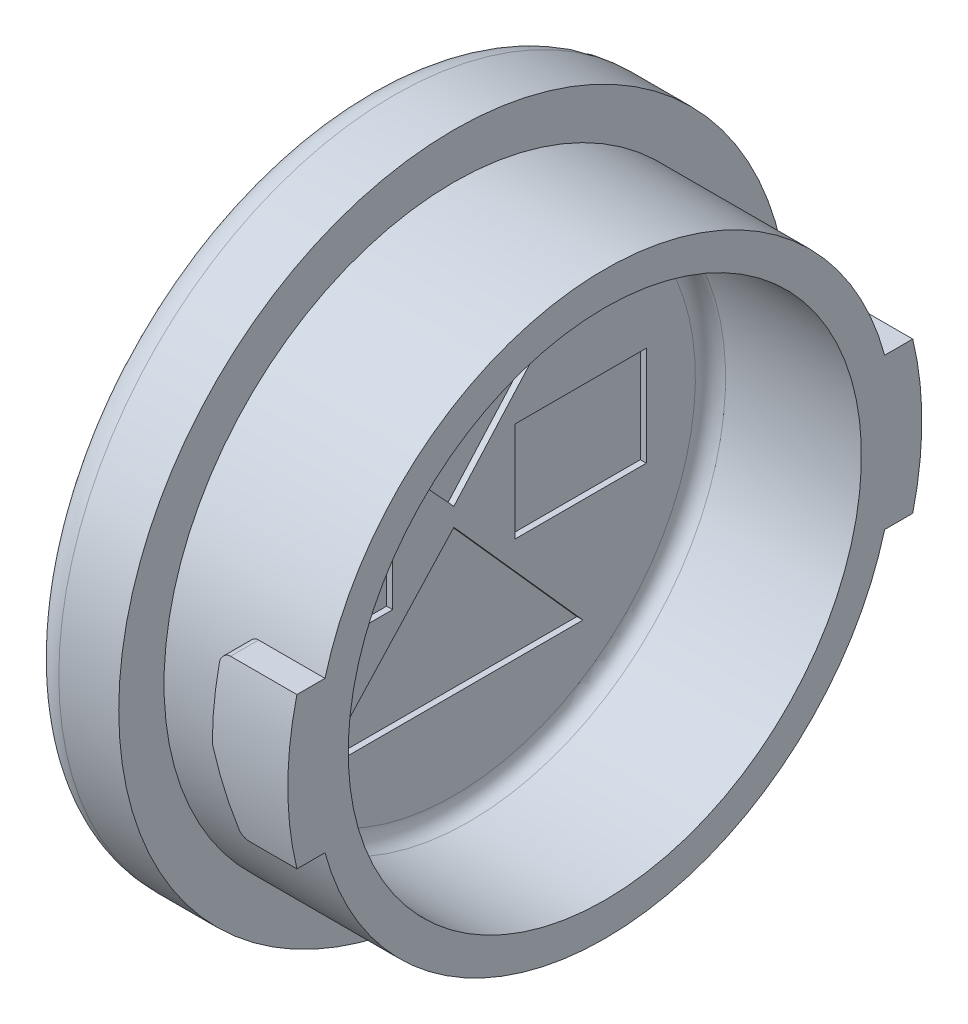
ISO-10303-21;
HEADER;
FILE_DESCRIPTION(('STEP AP214'),'2;1');
FILE_NAME('part.step','',(''),(''),'','','');
FILE_SCHEMA(('AUTOMOTIVE_DESIGN { 1 0 10303 214 1 1 1 1 }'));
ENDSEC;
DATA;
#1=APPLICATION_CONTEXT('core data for automotive mechanical design processes');
#2=APPLICATION_PROTOCOL_DEFINITION('international standard','automotive_design',2000,#1);
#3=PRODUCT_CONTEXT('',#1,'mechanical');
#4=PRODUCT('Part','Part','',(#3));
#5=PRODUCT_RELATED_PRODUCT_CATEGORY('part','',(#4));
#6=PRODUCT_DEFINITION_FORMATION('','',#4);
#7=PRODUCT_DEFINITION_CONTEXT('part definition',#1,'design');
#8=PRODUCT_DEFINITION('design','',#6,#7);
#9=PRODUCT_DEFINITION_SHAPE('','',#8);
#10=(LENGTH_UNIT() NAMED_UNIT(*) SI_UNIT(.MILLI.,.METRE.));
#11=(NAMED_UNIT(*) PLANE_ANGLE_UNIT() SI_UNIT($,.RADIAN.));
#12=(NAMED_UNIT(*) SI_UNIT($,.STERADIAN.) SOLID_ANGLE_UNIT());
#13=UNCERTAINTY_MEASURE_WITH_UNIT(LENGTH_MEASURE(1.E-05),#10,'distance_accuracy_value','');
#14=(GEOMETRIC_REPRESENTATION_CONTEXT(3) GLOBAL_UNCERTAINTY_ASSIGNED_CONTEXT((#13)) GLOBAL_UNIT_ASSIGNED_CONTEXT((#10,
#11,#12)) REPRESENTATION_CONTEXT('',''));
#15=CARTESIAN_POINT('',(0.,0.,0.));
#16=DIRECTION('',(0.,0.,1.));
#17=DIRECTION('',(1.,0.,0.));
#18=AXIS2_PLACEMENT_3D('',#15,#16,#17);
#19=CARTESIAN_POINT('',(-13.3000000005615,50.9,34.75));
#20=DIRECTION('',(0.,0.,-1.));
#21=DIRECTION('',(0.,1.,0.));
#22=AXIS2_PLACEMENT_3D('',#19,#20,#21);
#23=PLANE('',#22);
#24=DIRECTION('',(0.,1.,0.));
#25=VECTOR('',#24,1.);
#26=CARTESIAN_POINT('',(-3.50000000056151,50.9,34.75));
#27=LINE('',#26,#25);
#28=CARTESIAN_POINT('',(-3.50000000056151,57.8253158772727,34.75));
#29=VERTEX_POINT('',#28);
#30=CARTESIAN_POINT('',(-3.50000000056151,43.9746841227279,34.75));
#31=VERTEX_POINT('',#30);
#32=EDGE_CURVE('E141',#29,#31,#27,.F.);
#33=ORIENTED_EDGE('',*,*,#32,.T.);
#34=CARTESIAN_POINT('',(-13.3000000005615,50.9,34.75));
#35=DIRECTION('',(0.,0.,1.));
#36=DIRECTION('',(0.,-1.,0.));
#37=AXIS2_PLACEMENT_3D('',#34,#35,#36);
#38=CIRCLE('',#37,12.);
#39=EDGE_CURVE('E19',#31,#29,#38,.T.);
#40=ORIENTED_EDGE('',*,*,#39,.T.);
#41=EDGE_LOOP('',(#33,#40));
#42=FACE_BOUND('',#41,.T.);
#43=ADVANCED_FACE('F16',(#42),#23,.F.);
#44=CARTESIAN_POINT('',(-13.3000000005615,50.9,37.75));
#45=DIRECTION('',(0.,0.,1.));
#46=DIRECTION('',(0.,-1.,0.));
#47=AXIS2_PLACEMENT_3D('',#44,#45,#46);
#48=CYLINDRICAL_SURFACE('',#47,12.);
#49=DIRECTION('',(0.,0.,1.));
#50=VECTOR('',#49,1.);
#51=CARTESIAN_POINT('',(-3.50000000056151,57.8253158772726,36.25));
#52=LINE('',#51,#50);
#53=CARTESIAN_POINT('',(-3.50000000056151,57.8253158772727,37.75));
#54=VERTEX_POINT('',#53);
#55=EDGE_CURVE('E148',#54,#29,#52,.F.);
#56=ORIENTED_EDGE('',*,*,#55,.T.);
#57=ORIENTED_EDGE('',*,*,#39,.F.);
#58=DIRECTION('',(0.,0.,1.));
#59=VECTOR('',#58,1.);
#60=CARTESIAN_POINT('',(-3.50000000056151,43.9746841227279,36.25));
#61=LINE('',#60,#59);
#62=CARTESIAN_POINT('',(-3.50000000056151,43.9746841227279,37.75));
#63=VERTEX_POINT('',#62);
#64=EDGE_CURVE('E157',#31,#63,#61,.T.);
#65=ORIENTED_EDGE('',*,*,#64,.T.);
#66=CARTESIAN_POINT('',(-13.3000000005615,50.9,37.75));
#67=DIRECTION('',(0.,0.,1.));
#68=DIRECTION('',(0.,-1.,0.));
#69=AXIS2_PLACEMENT_3D('',#66,#67,#68);
#70=CIRCLE('',#69,12.);
#71=EDGE_CURVE('E146',#54,#63,#70,.F.);
#72=ORIENTED_EDGE('',*,*,#71,.F.);
#73=EDGE_LOOP('',(#56,#57,#65,#72));
#74=FACE_BOUND('',#73,.T.);
#75=ADVANCED_FACE('F149',(#74),#48,.F.);
#76=CARTESIAN_POINT('',(-13.3000000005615,50.9,37.75));
#77=DIRECTION('',(0.,0.,-1.));
#78=DIRECTION('',(0.,1.,0.));
#79=AXIS2_PLACEMENT_3D('',#76,#77,#78);
#80=PLANE('',#79);
#81=DIRECTION('',(0.,1.,0.));
#82=VECTOR('',#81,1.);
#83=CARTESIAN_POINT('',(-3.50000000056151,50.9,37.75));
#84=LINE('',#83,#82);
#85=EDGE_CURVE('E159',#63,#54,#84,.T.);
#86=ORIENTED_EDGE('',*,*,#85,.T.);
#87=ORIENTED_EDGE('',*,*,#71,.T.);
#88=EDGE_LOOP('',(#86,#87));
#89=FACE_BOUND('',#88,.T.);
#90=ADVANCED_FACE('F497',(#89),#80,.T.);
#91=CARTESIAN_POINT('',(-0.199999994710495,56.0000000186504,31.975000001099));
#92=DIRECTION('',(-1.,-2.49615247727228E-10,-5.49391886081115E-10));
#93=DIRECTION('',(-5.49391886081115E-10,0.,1.));
#94=AXIS2_PLACEMENT_3D('',#91,#92,#93);
#95=PLANE('',#94);
#96=DIRECTION('',(0.,0.735243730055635,0.677802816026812));
#97=VECTOR('',#96,1.);
#98=CARTESIAN_POINT('',(-0.199999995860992,56.0000000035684,40.6750000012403));
#99=LINE('',#98,#97);
#100=CARTESIAN_POINT('',(-0.199999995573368,51.2000000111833,36.249999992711));
#101=VERTEX_POINT('',#100);
#102=CARTESIAN_POINT('',(-0.199999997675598,56.0000000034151,40.6750000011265));
#103=VERTEX_POINT('',#102);
#104=EDGE_CURVE('E450',#101,#103,#99,.T.);
#105=ORIENTED_EDGE('',*,*,#104,.F.);
#106=DIRECTION('',(0.,-0.746765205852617,0.665087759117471));
#107=VECTOR('',#106,1.);
#108=CARTESIAN_POINT('',(-0.199999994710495,51.200000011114,36.2499999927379));
#109=LINE('',#108,#107);
#110=CARTESIAN_POINT('',(-0.199999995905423,56.0000000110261,31.9750000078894));
#111=VERTEX_POINT('',#110);
#112=EDGE_CURVE('E453',#111,#101,#109,.T.);
#113=ORIENTED_EDGE('',*,*,#112,.F.);
#114=DIRECTION('',(0.,1.75118018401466E-09,-1.));
#115=VECTOR('',#114,1.);
#116=CARTESIAN_POINT('',(-0.199999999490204,56.0000000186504,31.975000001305));
#117=LINE('',#116,#115);
#118=EDGE_CURVE('E975',#103,#111,#117,.T.);
#119=ORIENTED_EDGE('',*,*,#118,.F.);
#120=EDGE_LOOP('',(#105,#113,#119));
#121=FACE_BOUND('',#120,.T.);
#122=ADVANCED_FACE('F493',(#121),#95,.F.);
#123=CARTESIAN_POINT('',(-0.199999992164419,45.8000000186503,31.9749999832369));
#124=DIRECTION('',(1.,2.49615247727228E-10,5.49391886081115E-10));
#125=DIRECTION('',(5.49391886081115E-10,0.,-1.));
#126=AXIS2_PLACEMENT_3D('',#123,#124,#125);
#127=PLANE('',#126);
#128=DIRECTION('',(0.,0.74676520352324,0.665087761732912));
#129=VECTOR('',#128,1.);
#130=CARTESIAN_POINT('',(-0.199999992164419,50.6000000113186,36.2499999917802));
#131=LINE('',#130,#129);
#132=CARTESIAN_POINT('',(-0.199999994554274,45.8000000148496,31.9749999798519));
#133=VERTEX_POINT('',#132);
#134=CARTESIAN_POINT('',(-0.199999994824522,50.6000000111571,36.249999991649));
#135=VERTEX_POINT('',#134);
#136=EDGE_CURVE('E957',#133,#135,#131,.T.);
#137=ORIENTED_EDGE('',*,*,#136,.T.);
#138=DIRECTION('',(0.,-0.735243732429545,0.677802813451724));
#139=VECTOR('',#138,1.);
#140=CARTESIAN_POINT('',(-0.199999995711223,45.800000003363,40.6749999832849));
#141=LINE('',#140,#139);
#142=CARTESIAN_POINT('',(-0.199999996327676,45.8000000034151,40.6749999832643));
#143=VERTEX_POINT('',#142);
#144=EDGE_CURVE('E969',#135,#143,#141,.T.);
#145=ORIENTED_EDGE('',*,*,#144,.T.);
#146=DIRECTION('',(0.,1.75118018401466E-09,-1.));
#147=VECTOR('',#146,1.);
#148=CARTESIAN_POINT('',(-0.199999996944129,45.8000000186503,31.974999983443));
#149=LINE('',#148,#147);
#150=EDGE_CURVE('E963',#143,#133,#149,.T.);
#151=ORIENTED_EDGE('',*,*,#150,.T.);
#152=EDGE_LOOP('',(#137,#145,#151));
#153=FACE_BOUND('',#152,.T.);
#154=ADVANCED_FACE('F489',(#153),#127,.T.);
#155=CARTESIAN_POINT('',(-0.199999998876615,49.25,42.6249999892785));
#156=DIRECTION('',(1.,2.49615247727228E-10,5.49391886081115E-10));
#157=DIRECTION('',(5.49391886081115E-10,0.,-1.));
#158=AXIS2_PLACEMENT_3D('',#155,#156,#157);
#159=PLANE('',#158);
#160=DIRECTION('',(0.,-1.,-1.75118018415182E-09));
#161=VECTOR('',#160,1.);
#162=CARTESIAN_POINT('',(-0.199999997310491,49.2500000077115,38.2749999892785));
#163=LINE('',#162,#161);
#164=CARTESIAN_POINT('',(-0.199999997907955,52.5500000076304,38.2749999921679));
#165=VERTEX_POINT('',#164);
#166=CARTESIAN_POINT('',(-0.199999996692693,49.2500000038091,38.274999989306));
#167=VERTEX_POINT('',#166);
#168=EDGE_CURVE('E948',#165,#167,#163,.T.);
#169=ORIENTED_EDGE('',*,*,#168,.F.);
#170=DIRECTION('',(0.,1.75118018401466E-09,-1.));
#171=VECTOR('',#170,1.);
#172=CARTESIAN_POINT('',(-0.199999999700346,52.5500000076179,38.2749999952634));
#173=LINE('',#172,#171);
#174=CARTESIAN_POINT('',(-0.199999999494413,52.5500000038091,42.6249999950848));
#175=VERTEX_POINT('',#174);
#176=EDGE_CURVE('E942',#175,#165,#173,.T.);
#177=ORIENTED_EDGE('',*,*,#176,.F.);
#178=DIRECTION('',(0.,1.,1.75118018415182E-09));
#179=VECTOR('',#178,1.);
#180=CARTESIAN_POINT('',(-0.199999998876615,52.5500000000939,42.6249999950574));
#181=LINE('',#180,#179);
#182=CARTESIAN_POINT('',(-0.199999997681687,49.2500000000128,42.6249999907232));
#183=VERTEX_POINT('',#182);
#184=EDGE_CURVE('E933',#183,#175,#181,.T.);
#185=ORIENTED_EDGE('',*,*,#184,.F.);
#186=DIRECTION('',(0.,-1.75118018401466E-09,1.));
#187=VECTOR('',#186,1.);
#188=CARTESIAN_POINT('',(-0.19999999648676,49.25,42.6249999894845));
#189=LINE('',#188,#187);
#190=EDGE_CURVE('E951',#167,#183,#189,.T.);
#191=ORIENTED_EDGE('',*,*,#190,.F.);
#192=EDGE_LOOP('',(#169,#177,#185,#191));
#193=FACE_BOUND('',#192,.T.);
#194=ADVANCED_FACE('F485',(#193),#159,.T.);
#195=CARTESIAN_POINT('',(-0.199999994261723,49.2500000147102,34.2249999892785));
#196=DIRECTION('',(1.,2.49615247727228E-10,5.49391886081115E-10));
#197=DIRECTION('',(5.49391886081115E-10,0.,-1.));
#198=AXIS2_PLACEMENT_3D('',#195,#196,#197);
#199=PLANE('',#198);
#200=DIRECTION('',(0.,-1.,-1.75118018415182E-09));
#201=VECTOR('',#200,1.);
#202=CARTESIAN_POINT('',(-0.1999999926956,49.2500000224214,29.8749999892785));
#203=LINE('',#202,#201);
#204=CARTESIAN_POINT('',(-0.199999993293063,52.5500000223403,29.874999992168));
#205=VERTEX_POINT('',#204);
#206=CARTESIAN_POINT('',(-0.199999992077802,49.250000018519,29.874999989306));
#207=VERTEX_POINT('',#206);
#208=EDGE_CURVE('E924',#205,#207,#203,.T.);
#209=ORIENTED_EDGE('',*,*,#208,.F.);
#210=DIRECTION('',(0.,1.75118018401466E-09,-1.));
#211=VECTOR('',#210,1.);
#212=CARTESIAN_POINT('',(-0.199999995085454,52.5500000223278,29.8749999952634));
#213=LINE('',#212,#211);
#214=CARTESIAN_POINT('',(-0.199999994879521,52.550000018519,34.2249999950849));
#215=VERTEX_POINT('',#214);
#216=EDGE_CURVE('E918',#215,#205,#213,.T.);
#217=ORIENTED_EDGE('',*,*,#216,.F.);
#218=DIRECTION('',(0.,1.,1.75118018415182E-09));
#219=VECTOR('',#218,1.);
#220=CARTESIAN_POINT('',(-0.199999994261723,52.5500000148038,34.2249999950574));
#221=LINE('',#220,#219);
#222=CARTESIAN_POINT('',(-0.199999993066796,49.2500000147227,34.2249999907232));
#223=VERTEX_POINT('',#222);
#224=EDGE_CURVE('E907',#223,#215,#221,.T.);
#225=ORIENTED_EDGE('',*,*,#224,.F.);
#226=DIRECTION('',(0.,-1.75118018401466E-09,1.));
#227=VECTOR('',#226,1.);
#228=CARTESIAN_POINT('',(-0.199999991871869,49.2500000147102,34.2249999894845));
#229=LINE('',#228,#227);
#230=EDGE_CURVE('E927',#207,#223,#229,.T.);
#231=ORIENTED_EDGE('',*,*,#230,.F.);
#232=EDGE_LOOP('',(#209,#217,#225,#231));
#233=FACE_BOUND('',#232,.T.);
#234=ADVANCED_FACE('F481',(#233),#199,.T.);
#235=CARTESIAN_POINT('',(-3.50000000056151,50.9,36.25));
#236=DIRECTION('',(1.,0.,0.));
#237=DIRECTION('',(0.,1.,0.));
#238=AXIS2_PLACEMENT_3D('',#235,#236,#237);
#239=PLANE('',#238);
#240=ORIENTED_EDGE('',*,*,#64,.F.);
#241=ORIENTED_EDGE('',*,*,#32,.F.);
#242=ORIENTED_EDGE('',*,*,#55,.F.);
#243=ORIENTED_EDGE('',*,*,#85,.F.);
#244=EDGE_LOOP('',(#240,#241,#242,#243));
#245=FACE_BOUND('',#244,.T.);
#246=CARTESIAN_POINT('',(-3.50000000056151,50.9,36.25));
#247=DIRECTION('',(1.,0.,0.));
#248=DIRECTION('',(0.,-1.,0.));
#249=AXIS2_PLACEMENT_3D('',#246,#247,#248);
#250=CIRCLE('',#249,8.58545281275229);
#251=CARTESIAN_POINT('',(-3.50000000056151,42.3145471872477,36.25));
#252=VERTEX_POINT('',#251);
#253=EDGE_CURVE('E467',#252,#252,#250,.T.);
#254=ORIENTED_EDGE('',*,*,#253,.F.);
#255=EDGE_LOOP('',(#254));
#256=FACE_BOUND('',#255,.T.);
#257=ADVANCED_FACE('F155',(#245,#256),#239,.F.);
#258=CARTESIAN_POINT('',(0.175000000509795,56.0000000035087,40.675000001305));
#259=DIRECTION('',(2.34747021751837E-10,0.677802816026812,-0.735243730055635));
#260=DIRECTION('',(0.,0.735243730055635,0.677802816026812));
#261=AXIS2_PLACEMENT_3D('',#258,#259,#260);
#262=PLANE('',#261);
#263=ORIENTED_EDGE('',*,*,#104,.T.);
#264=DIRECTION('',(1.,2.49615248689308E-10,0.));
#265=VECTOR('',#264,1.);
#266=CARTESIAN_POINT('',(0.175000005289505,56.0000000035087,40.6750000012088));
#267=LINE('',#266,#265);
#268=CARTESIAN_POINT('',(-5.61517846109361E-10,56.000000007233,40.6750000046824));
#269=VERTEX_POINT('',#268);
#270=EDGE_CURVE('E978',#269,#103,#267,.F.);
#271=ORIENTED_EDGE('',*,*,#270,.F.);
#272=DIRECTION('',(0.,-0.735243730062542,-0.67780281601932));
#273=VECTOR('',#272,1.);
#274=CARTESIAN_POINT('',(-5.61517846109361E-10,56.000000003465,40.6750000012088));
#275=LINE('',#274,#273);
#276=CARTESIAN_POINT('',(-5.61517866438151E-10,51.2000000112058,36.2499999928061));
#277=VERTEX_POINT('',#276);
#278=EDGE_CURVE('E901',#269,#277,#275,.T.);
#279=ORIENTED_EDGE('',*,*,#278,.T.);
#280=DIRECTION('',(1.,3.83278629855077E-10,4.3034793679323E-10));
#281=VECTOR('',#280,1.);
#282=CARTESIAN_POINT('',(0.175000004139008,51.2000000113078,36.2499999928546));
#283=LINE('',#282,#281);
#284=EDGE_CURVE('E462',#101,#277,#283,.T.);
#285=ORIENTED_EDGE('',*,*,#284,.F.);
#286=EDGE_LOOP('',(#263,#271,#279,#285));
#287=FACE_BOUND('',#286,.T.);
#288=ADVANCED_FACE('F480',(#287),#262,.T.);
#289=CARTESIAN_POINT('',(0.175000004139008,51.2000000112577,36.2499999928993));
#290=DIRECTION('',(-5.76282790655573E-10,0.665087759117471,0.746765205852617));
#291=DIRECTION('',(0.,-0.746765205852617,0.665087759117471));
#292=AXIS2_PLACEMENT_3D('',#289,#290,#291);
#293=PLANE('',#292);
#294=ORIENTED_EDGE('',*,*,#112,.T.);
#295=ORIENTED_EDGE('',*,*,#284,.T.);
#296=DIRECTION('',(0.,0.746765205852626,-0.665087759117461));
#297=VECTOR('',#296,1.);
#298=CARTESIAN_POINT('',(-5.61517846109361E-10,51.2000000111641,36.2499999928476));
#299=LINE('',#298,#297);
#300=CARTESIAN_POINT('',(-5.61517886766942E-10,56.0000000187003,31.9750000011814));
#301=VERTEX_POINT('',#300);
#302=EDGE_CURVE('E899',#277,#301,#299,.T.);
#303=ORIENTED_EDGE('',*,*,#302,.T.);
#304=DIRECTION('',(1.,2.49615248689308E-10,0.));
#305=VECTOR('',#304,1.);
#306=CARTESIAN_POINT('',(0.175000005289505,56.000000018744,31.975000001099));
#307=LINE('',#306,#305);
#308=EDGE_CURVE('E972',#111,#301,#307,.T.);
#309=ORIENTED_EDGE('',*,*,#308,.F.);
#310=EDGE_LOOP('',(#294,#295,#303,#309));
#311=FACE_BOUND('',#310,.T.);
#312=ADVANCED_FACE('F520',(#311),#293,.T.);
#313=CARTESIAN_POINT('',(0.175000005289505,56.000000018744,31.975000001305));
#314=DIRECTION('',(2.49615248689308E-10,-1.,-1.75118018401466E-09));
#315=DIRECTION('',(0.,1.75118018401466E-09,-1.));
#316=AXIS2_PLACEMENT_3D('',#313,#314,#315);
#317=PLANE('',#316);
#318=ORIENTED_EDGE('',*,*,#118,.T.);
#319=ORIENTED_EDGE('',*,*,#308,.T.);
#320=DIRECTION('',(0.,0.,1.));
#321=VECTOR('',#320,1.);
#322=CARTESIAN_POINT('',(-5.61517846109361E-10,56.0000000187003,27.75));
#323=LINE('',#322,#321);
#324=EDGE_CURVE('E896',#301,#269,#323,.T.);
#325=ORIENTED_EDGE('',*,*,#324,.T.);
#326=ORIENTED_EDGE('',*,*,#270,.T.);
#327=EDGE_LOOP('',(#318,#319,#325,#326));
#328=FACE_BOUND('',#327,.T.);
#329=ADVANCED_FACE('F526',(#328),#317,.T.);
#330=CARTESIAN_POINT('',(0.17500000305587,45.8000000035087,40.6749999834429));
#331=DIRECTION('',(-5.73126858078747E-10,0.677802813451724,0.735243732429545));
#332=DIRECTION('',(0.,-0.735243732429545,0.677802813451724));
#333=AXIS2_PLACEMENT_3D('',#330,#331,#332);
#334=PLANE('',#333);
#335=ORIENTED_EDGE('',*,*,#144,.F.);
#336=DIRECTION('',(1.,-1.62448149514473E-10,1.82397921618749E-10));
#337=VECTOR('',#336,1.);
#338=CARTESIAN_POINT('',(0.175000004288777,50.6000000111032,36.249999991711));
#339=LINE('',#338,#337);
#340=CARTESIAN_POINT('',(-5.61517866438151E-10,50.6000000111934,36.2499999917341));
#341=VERTEX_POINT('',#340);
#342=EDGE_CURVE('E954',#135,#341,#339,.T.);
#343=ORIENTED_EDGE('',*,*,#342,.T.);
#344=DIRECTION('',(0.,-0.735243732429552,0.677802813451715));
#345=VECTOR('',#344,1.);
#346=CARTESIAN_POINT('',(-5.61517846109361E-10,50.600000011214,36.2499999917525));
#347=LINE('',#346,#345);
#348=CARTESIAN_POINT('',(-5.61517846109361E-10,45.8000000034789,40.674999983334));
#349=VERTEX_POINT('',#348);
#350=EDGE_CURVE('E893',#341,#349,#347,.T.);
#351=ORIENTED_EDGE('',*,*,#350,.T.);
#352=DIRECTION('',(1.,2.49615248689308E-10,0.));
#353=VECTOR('',#352,1.);
#354=CARTESIAN_POINT('',(0.17500000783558,45.8000000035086,40.6749999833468));
#355=LINE('',#354,#353);
#356=EDGE_CURVE('E966',#349,#143,#355,.F.);
#357=ORIENTED_EDGE('',*,*,#356,.T.);
#358=EDGE_LOOP('',(#335,#343,#351,#357));
#359=FACE_BOUND('',#358,.T.);
#360=ADVANCED_FACE('F533',(#359),#334,.F.);
#361=CARTESIAN_POINT('',(0.17500000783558,45.8000000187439,31.974999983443));
#362=DIRECTION('',(2.49615248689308E-10,-1.,-1.75118018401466E-09));
#363=DIRECTION('',(0.,1.75118018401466E-09,-1.));
#364=AXIS2_PLACEMENT_3D('',#361,#362,#363);
#365=PLANE('',#364);
#366=ORIENTED_EDGE('',*,*,#150,.F.);
#367=ORIENTED_EDGE('',*,*,#356,.F.);
#368=DIRECTION('',(0.,0.,1.));
#369=VECTOR('',#368,1.);
#370=CARTESIAN_POINT('',(-5.61517846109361E-10,45.800000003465,27.75));
#371=LINE('',#370,#369);
#372=CARTESIAN_POINT('',(-5.61517866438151E-10,45.800000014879,31.9749999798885));
#373=VERTEX_POINT('',#372);
#374=EDGE_CURVE('E890',#349,#373,#371,.F.);
#375=ORIENTED_EDGE('',*,*,#374,.T.);
#376=DIRECTION('',(1.,-1.62448149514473E-10,1.82397921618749E-10));
#377=VECTOR('',#376,1.);
#378=CARTESIAN_POINT('',(0.175000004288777,45.800000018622,31.9749999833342));
#379=LINE('',#378,#377);
#380=EDGE_CURVE('E960',#373,#133,#379,.F.);
#381=ORIENTED_EDGE('',*,*,#380,.T.);
#382=EDGE_LOOP('',(#366,#367,#375,#381));
#383=FACE_BOUND('',#382,.T.);
#384=ADVANCED_FACE('F541',(#383),#365,.F.);
#385=CARTESIAN_POINT('',(0.175000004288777,50.6000000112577,36.2499999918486));
#386=DIRECTION('',(2.44250697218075E-10,0.665087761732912,-0.74676520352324));
#387=DIRECTION('',(0.,0.74676520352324,0.665087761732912));
#388=AXIS2_PLACEMENT_3D('',#385,#386,#387);
#389=PLANE('',#388);
#390=ORIENTED_EDGE('',*,*,#136,.F.);
#391=ORIENTED_EDGE('',*,*,#380,.F.);
#392=DIRECTION('',(0.,0.746765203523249,0.665087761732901));
#393=VECTOR('',#392,1.);
#394=CARTESIAN_POINT('',(-5.61517846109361E-10,45.8000000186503,31.9749999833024));
#395=LINE('',#394,#393);
#396=EDGE_CURVE('E887',#373,#341,#395,.T.);
#397=ORIENTED_EDGE('',*,*,#396,.T.);
#398=ORIENTED_EDGE('',*,*,#342,.F.);
#399=EDGE_LOOP('',(#390,#391,#397,#398));
#400=FACE_BOUND('',#399,.T.);
#401=ADVANCED_FACE('F549',(#400),#389,.F.);
#402=CARTESIAN_POINT('',(0.175000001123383,49.2500000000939,42.6249999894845));
#403=DIRECTION('',(-2.49615248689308E-10,1.,1.75118018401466E-09));
#404=DIRECTION('',(0.,-1.75118018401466E-09,1.));
#405=AXIS2_PLACEMENT_3D('',#402,#403,#404);
#406=PLANE('',#405);
#407=ORIENTED_EDGE('',*,*,#190,.T.);
#408=DIRECTION('',(1.,0.,5.49391885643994E-10));
#409=VECTOR('',#408,1.);
#410=CARTESIAN_POINT('',(0.175000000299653,49.2500000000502,42.6249999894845));
#411=LINE('',#410,#409);
#412=CARTESIAN_POINT('',(-5.61517846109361E-10,49.2500000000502,42.6249999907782));
#413=VERTEX_POINT('',#412);
#414=EDGE_CURVE('E936',#413,#183,#411,.F.);
#415=ORIENTED_EDGE('',*,*,#414,.F.);
#416=DIRECTION('',(0.,0.,1.));
#417=VECTOR('',#416,1.);
#418=CARTESIAN_POINT('',(-5.61517846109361E-10,49.2500000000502,27.75));
#419=LINE('',#418,#417);
#420=CARTESIAN_POINT('',(-5.61517846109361E-10,49.250000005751,38.2749999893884));
#421=VERTEX_POINT('',#420);
#422=EDGE_CURVE('E884',#413,#421,#419,.F.);
#423=ORIENTED_EDGE('',*,*,#422,.T.);
#424=DIRECTION('',(1.,0.,5.49391885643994E-10));
#425=VECTOR('',#424,1.);
#426=CARTESIAN_POINT('',(0.175000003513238,49.2500000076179,38.2749999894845));
#427=LINE('',#426,#425);
#428=EDGE_CURVE('E945',#167,#421,#427,.T.);
#429=ORIENTED_EDGE('',*,*,#428,.F.);
#430=EDGE_LOOP('',(#407,#415,#423,#429));
#431=FACE_BOUND('',#430,.T.);
#432=ADVANCED_FACE('F557',(#431),#406,.T.);
#433=CARTESIAN_POINT('',(0.175000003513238,49.2500000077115,38.2749999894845));
#434=DIRECTION('',(-5.49391885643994E-10,-1.75118018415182E-09,1.));
#435=DIRECTION('',(0.,-1.,-1.75118018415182E-09));
#436=AXIS2_PLACEMENT_3D('',#433,#434,#435);
#437=PLANE('',#436);
#438=ORIENTED_EDGE('',*,*,#168,.T.);
#439=ORIENTED_EDGE('',*,*,#428,.T.);
#440=DIRECTION('',(0.,-1.,0.));
#441=VECTOR('',#440,1.);
#442=CARTESIAN_POINT('',(-5.61517846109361E-10,50.9,38.2749999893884));
#443=LINE('',#442,#441);
#444=CARTESIAN_POINT('',(-5.61517846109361E-10,52.5500000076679,38.2749999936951));
#445=VERTEX_POINT('',#444);
#446=EDGE_CURVE('E881',#421,#445,#443,.F.);
#447=ORIENTED_EDGE('',*,*,#446,.T.);
#448=DIRECTION('',(1.,2.49615248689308E-10,0.));
#449=VECTOR('',#448,1.);
#450=CARTESIAN_POINT('',(0.175000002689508,52.5500000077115,38.2749999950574));
#451=LINE('',#450,#449);
#452=EDGE_CURVE('E939',#165,#445,#451,.T.);
#453=ORIENTED_EDGE('',*,*,#452,.F.);
#454=EDGE_LOOP('',(#438,#439,#447,#453));
#455=FACE_BOUND('',#454,.T.);
#456=ADVANCED_FACE('F565',(#455),#437,.T.);
#457=CARTESIAN_POINT('',(0.175000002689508,52.5500000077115,38.2749999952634));
#458=DIRECTION('',(2.49615248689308E-10,-1.,-1.75118018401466E-09));
#459=DIRECTION('',(0.,1.75118018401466E-09,-1.));
#460=AXIS2_PLACEMENT_3D('',#457,#458,#459);
#461=PLANE('',#460);
#462=ORIENTED_EDGE('',*,*,#176,.T.);
#463=ORIENTED_EDGE('',*,*,#452,.T.);
#464=DIRECTION('',(0.,0.,1.));
#465=VECTOR('',#464,1.);
#466=CARTESIAN_POINT('',(-5.61517846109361E-10,52.5500000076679,27.75));
#467=LINE('',#466,#465);
#468=CARTESIAN_POINT('',(-5.61517846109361E-10,52.5500000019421,42.6249999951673));
#469=VERTEX_POINT('',#468);
#470=EDGE_CURVE('E878',#445,#469,#467,.T.);
#471=ORIENTED_EDGE('',*,*,#470,.T.);
#472=DIRECTION('',(1.,0.,5.49391885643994E-10));
#473=VECTOR('',#472,1.);
#474=CARTESIAN_POINT('',(0.175000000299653,52.55,42.6249999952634));
#475=LINE('',#474,#473);
#476=EDGE_CURVE('E930',#175,#469,#475,.T.);
#477=ORIENTED_EDGE('',*,*,#476,.F.);
#478=EDGE_LOOP('',(#462,#463,#471,#477));
#479=FACE_BOUND('',#478,.T.);
#480=ADVANCED_FACE('F573',(#479),#461,.T.);
#481=CARTESIAN_POINT('',(0.175000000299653,52.5500000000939,42.6249999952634));
#482=DIRECTION('',(5.49391885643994E-10,1.75118018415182E-09,-1.));
#483=DIRECTION('',(0.,1.,1.75118018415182E-09));
#484=AXIS2_PLACEMENT_3D('',#481,#482,#483);
#485=PLANE('',#484);
#486=ORIENTED_EDGE('',*,*,#184,.T.);
#487=ORIENTED_EDGE('',*,*,#476,.T.);
#488=DIRECTION('',(0.,-1.,0.));
#489=VECTOR('',#488,1.);
#490=CARTESIAN_POINT('',(-5.61517846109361E-10,50.9,42.6249999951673));
#491=LINE('',#490,#489);
#492=EDGE_CURVE('E875',#469,#413,#491,.T.);
#493=ORIENTED_EDGE('',*,*,#492,.T.);
#494=ORIENTED_EDGE('',*,*,#414,.T.);
#495=EDGE_LOOP('',(#486,#487,#493,#494));
#496=FACE_BOUND('',#495,.T.);
#497=ADVANCED_FACE('F581',(#496),#485,.T.);
#498=CARTESIAN_POINT('',(0.175000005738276,49.2500000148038,34.2249999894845));
#499=DIRECTION('',(-2.49615248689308E-10,1.,1.75118018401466E-09));
#500=DIRECTION('',(0.,-1.75118018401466E-09,1.));
#501=AXIS2_PLACEMENT_3D('',#498,#499,#500);
#502=PLANE('',#501);
#503=ORIENTED_EDGE('',*,*,#230,.T.);
#504=DIRECTION('',(1.,0.,5.49391885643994E-10));
#505=VECTOR('',#504,1.);
#506=CARTESIAN_POINT('',(0.175000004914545,49.2500000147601,34.2249999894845));
#507=LINE('',#506,#505);
#508=CARTESIAN_POINT('',(-5.61517846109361E-10,49.2500000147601,34.2249999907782));
#509=VERTEX_POINT('',#508);
#510=EDGE_CURVE('E910',#509,#223,#507,.F.);
#511=ORIENTED_EDGE('',*,*,#510,.F.);
#512=DIRECTION('',(0.,0.,1.));
#513=VECTOR('',#512,1.);
#514=CARTESIAN_POINT('',(-5.61517846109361E-10,49.2500000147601,27.75));
#515=LINE('',#514,#513);
#516=CARTESIAN_POINT('',(-5.61517846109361E-10,49.2500000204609,29.8749999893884));
#517=VERTEX_POINT('',#516);
#518=EDGE_CURVE('E872',#509,#517,#515,.F.);
#519=ORIENTED_EDGE('',*,*,#518,.T.);
#520=DIRECTION('',(1.,0.,5.49391885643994E-10));
#521=VECTOR('',#520,1.);
#522=CARTESIAN_POINT('',(0.17500000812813,49.2500000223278,29.8749999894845));
#523=LINE('',#522,#521);
#524=EDGE_CURVE('E921',#207,#517,#523,.T.);
#525=ORIENTED_EDGE('',*,*,#524,.F.);
#526=EDGE_LOOP('',(#503,#511,#519,#525));
#527=FACE_BOUND('',#526,.T.);
#528=ADVANCED_FACE('F589',(#527),#502,.T.);
#529=CARTESIAN_POINT('',(0.17500000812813,49.2500000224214,29.8749999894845));
#530=DIRECTION('',(-5.49391885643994E-10,-1.75118018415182E-09,1.));
#531=DIRECTION('',(0.,-1.,-1.75118018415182E-09));
#532=AXIS2_PLACEMENT_3D('',#529,#530,#531);
#533=PLANE('',#532);
#534=ORIENTED_EDGE('',*,*,#208,.T.);
#535=ORIENTED_EDGE('',*,*,#524,.T.);
#536=DIRECTION('',(0.,-1.,0.));
#537=VECTOR('',#536,1.);
#538=CARTESIAN_POINT('',(-5.61517846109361E-10,50.9,29.8749999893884));
#539=LINE('',#538,#537);
#540=CARTESIAN_POINT('',(-5.61517846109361E-10,52.5500000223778,29.8749999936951));
#541=VERTEX_POINT('',#540);
#542=EDGE_CURVE('E864',#517,#541,#539,.F.);
#543=ORIENTED_EDGE('',*,*,#542,.T.);
#544=DIRECTION('',(1.,2.49615248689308E-10,0.));
#545=VECTOR('',#544,1.);
#546=CARTESIAN_POINT('',(0.1750000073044,52.5500000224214,29.8749999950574));
#547=LINE('',#546,#545);
#548=EDGE_CURVE('E913',#205,#541,#547,.T.);
#549=ORIENTED_EDGE('',*,*,#548,.F.);
#550=EDGE_LOOP('',(#534,#535,#543,#549));
#551=FACE_BOUND('',#550,.T.);
#552=ADVANCED_FACE('F597',(#551),#533,.T.);
#553=CARTESIAN_POINT('',(0.1750000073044,52.5500000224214,29.8749999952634));
#554=DIRECTION('',(2.49615248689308E-10,-1.,-1.75118018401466E-09));
#555=DIRECTION('',(0.,1.75118018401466E-09,-1.));
#556=AXIS2_PLACEMENT_3D('',#553,#554,#555);
#557=PLANE('',#556);
#558=ORIENTED_EDGE('',*,*,#216,.T.);
#559=ORIENTED_EDGE('',*,*,#548,.T.);
#560=DIRECTION('',(0.,0.,1.));
#561=VECTOR('',#560,1.);
#562=CARTESIAN_POINT('',(-5.61517846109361E-10,52.5500000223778,27.75));
#563=LINE('',#562,#561);
#564=CARTESIAN_POINT('',(-5.61517846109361E-10,52.550000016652,34.2249999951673));
#565=VERTEX_POINT('',#564);
#566=EDGE_CURVE('E856',#541,#565,#563,.T.);
#567=ORIENTED_EDGE('',*,*,#566,.T.);
#568=DIRECTION('',(1.,0.,5.49391885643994E-10));
#569=VECTOR('',#568,1.);
#570=CARTESIAN_POINT('',(0.175000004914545,52.5500000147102,34.2249999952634));
#571=LINE('',#570,#569);
#572=EDGE_CURVE('E427',#215,#565,#571,.T.);
#573=ORIENTED_EDGE('',*,*,#572,.F.);
#574=EDGE_LOOP('',(#558,#559,#567,#573));
#575=FACE_BOUND('',#574,.T.);
#576=ADVANCED_FACE('F605',(#575),#557,.T.);
#577=CARTESIAN_POINT('',(0.175000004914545,52.5500000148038,34.2249999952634));
#578=DIRECTION('',(5.49391885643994E-10,1.75118018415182E-09,-1.));
#579=DIRECTION('',(0.,1.,1.75118018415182E-09));
#580=AXIS2_PLACEMENT_3D('',#577,#578,#579);
#581=PLANE('',#580);
#582=ORIENTED_EDGE('',*,*,#224,.T.);
#583=ORIENTED_EDGE('',*,*,#572,.T.);
#584=DIRECTION('',(0.,-1.,0.));
#585=VECTOR('',#584,1.);
#586=CARTESIAN_POINT('',(-5.61517846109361E-10,50.9,34.2249999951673));
#587=LINE('',#586,#585);
#588=EDGE_CURVE('E852',#565,#509,#587,.T.);
#589=ORIENTED_EDGE('',*,*,#588,.T.);
#590=ORIENTED_EDGE('',*,*,#510,.T.);
#591=EDGE_LOOP('',(#582,#583,#589,#590));
#592=FACE_BOUND('',#591,.T.);
#593=ADVANCED_FACE('F435',(#592),#581,.T.);
#594=CARTESIAN_POINT('',(-2.50000000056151,50.9,36.25));
#595=DIRECTION('',(1.,0.,0.));
#596=DIRECTION('',(0.,-1.,0.));
#597=AXIS2_PLACEMENT_3D('',#594,#595,#596);
#598=TOROIDAL_SURFACE('',#597,8.58545281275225,1.);
#599=CARTESIAN_POINT('',(-3.45517241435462,50.9,36.25));
#600=DIRECTION('',(1.,0.,0.));
#601=DIRECTION('',(0.,-1.,0.));
#602=AXIS2_PLACEMENT_3D('',#599,#600,#601);
#603=CIRCLE('',#602,8.881502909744);
#604=CARTESIAN_POINT('',(-3.45517241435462,42.018497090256,36.25));
#605=VERTEX_POINT('',#604);
#606=EDGE_CURVE('E849',#605,#605,#603,.T.);
#607=ORIENTED_EDGE('',*,*,#606,.F.);
#608=EDGE_LOOP('',(#607));
#609=FACE_BOUND('',#608,.T.);
#610=ORIENTED_EDGE('',*,*,#253,.T.);
#611=EDGE_LOOP('',(#610));
#612=FACE_BOUND('',#611,.T.);
#613=ADVANCED_FACE('F430',(#609,#612),#598,.T.);
#614=CARTESIAN_POINT('',(-5.61517846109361E-10,50.9,27.75));
#615=DIRECTION('',(-1.,0.,0.));
#616=DIRECTION('',(0.,-1.,0.));
#617=AXIS2_PLACEMENT_3D('',#614,#615,#616);
#618=PLANE('',#617);
#619=ORIENTED_EDGE('',*,*,#566,.F.);
#620=ORIENTED_EDGE('',*,*,#542,.F.);
#621=ORIENTED_EDGE('',*,*,#518,.F.);
#622=ORIENTED_EDGE('',*,*,#588,.F.);
#623=EDGE_LOOP('',(#619,#620,#621,#622));
#624=FACE_BOUND('',#623,.T.);
#625=ORIENTED_EDGE('',*,*,#470,.F.);
#626=ORIENTED_EDGE('',*,*,#446,.F.);
#627=ORIENTED_EDGE('',*,*,#422,.F.);
#628=ORIENTED_EDGE('',*,*,#492,.F.);
#629=EDGE_LOOP('',(#625,#626,#627,#628));
#630=FACE_BOUND('',#629,.T.);
#631=ORIENTED_EDGE('',*,*,#374,.F.);
#632=ORIENTED_EDGE('',*,*,#350,.F.);
#633=ORIENTED_EDGE('',*,*,#396,.F.);
#634=EDGE_LOOP('',(#631,#632,#633));
#635=FACE_BOUND('',#634,.T.);
#636=ORIENTED_EDGE('',*,*,#302,.F.);
#637=ORIENTED_EDGE('',*,*,#278,.F.);
#638=ORIENTED_EDGE('',*,*,#324,.F.);
#639=EDGE_LOOP('',(#636,#637,#638));
#640=FACE_BOUND('',#639,.T.);
#641=CARTESIAN_POINT('',(-5.6151903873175E-10,50.9,36.25));
#642=DIRECTION('',(-1.,0.,0.));
#643=DIRECTION('',(0.,1.,0.));
#644=AXIS2_PLACEMENT_3D('',#641,#642,#643);
#645=CIRCLE('',#644,7.99999999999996);
#646=CARTESIAN_POINT('',(-5.6151903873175E-10,58.9,36.25));
#647=VERTEX_POINT('',#646);
#648=EDGE_CURVE('E847',#647,#647,#645,.F.);
#649=ORIENTED_EDGE('',*,*,#648,.T.);
#650=EDGE_LOOP('',(#649));
#651=FACE_BOUND('',#650,.T.);
#652=ADVANCED_FACE('F434',(#624,#630,#635,#640,#651),#618,.F.);
#653=CARTESIAN_POINT('',(25.1999999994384,50.9,36.25));
#654=DIRECTION('',(0.,0.,-1.));
#655=DIRECTION('',(0.,1.,0.));
#656=AXIS2_PLACEMENT_3D('',#653,#654,#655);
#657=SPHERICAL_SURFACE('',#656,30.);
#658=CARTESIAN_POINT('',(-2.92176259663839,50.9,36.25));
#659=DIRECTION('',(1.,0.,0.));
#660=DIRECTION('',(0.,-1.,0.));
#661=AXIS2_PLACEMENT_3D('',#658,#659,#660);
#662=CIRCLE('',#661,10.448275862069);
#663=CARTESIAN_POINT('',(-2.92176259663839,40.451724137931,36.25));
#664=VERTEX_POINT('',#663);
#665=EDGE_CURVE('E396',#664,#664,#662,.T.);
#666=ORIENTED_EDGE('',*,*,#665,.F.);
#667=EDGE_LOOP('',(#666));
#668=FACE_BOUND('',#667,.T.);
#669=ORIENTED_EDGE('',*,*,#606,.T.);
#670=EDGE_LOOP('',(#669));
#671=FACE_BOUND('',#670,.T.);
#672=ADVANCED_FACE('F410',(#668,#671),#657,.T.);
#673=CARTESIAN_POINT('',(0.499999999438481,50.9,36.25));
#674=DIRECTION('',(-1.,0.,0.));
#675=DIRECTION('',(0.,1.,0.));
#676=AXIS2_PLACEMENT_3D('',#673,#674,#675);
#677=TOROIDAL_SURFACE('',#676,8.,0.5);
#678=ORIENTED_EDGE('',*,*,#648,.F.);
#679=EDGE_LOOP('',(#678));
#680=FACE_BOUND('',#679,.T.);
#681=CARTESIAN_POINT('',(0.499999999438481,50.9,36.25));
#682=DIRECTION('',(-1.,0.,0.));
#683=DIRECTION('',(0.,-1.,0.));
#684=AXIS2_PLACEMENT_3D('',#681,#682,#683);
#685=CIRCLE('',#684,8.5);
#686=CARTESIAN_POINT('',(0.499999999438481,42.4,36.25));
#687=VERTEX_POINT('',#686);
#688=EDGE_CURVE('E393',#687,#687,#685,.F.);
#689=ORIENTED_EDGE('',*,*,#688,.T.);
#690=EDGE_LOOP('',(#689));
#691=FACE_BOUND('',#690,.T.);
#692=ADVANCED_FACE('F406',(#680,#691),#677,.F.);
#693=CARTESIAN_POINT('',(-1.98437051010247,50.9,36.25));
#694=DIRECTION('',(1.,0.,0.));
#695=DIRECTION('',(0.,-1.,0.));
#696=AXIS2_PLACEMENT_3D('',#693,#694,#695);
#697=TOROIDAL_SURFACE('',#696,10.1,1.);
#698=CARTESIAN_POINT('',(-1.98437051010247,50.9,36.25));
#699=DIRECTION('',(-1.,0.,0.));
#700=DIRECTION('',(0.,-1.,0.));
#701=AXIS2_PLACEMENT_3D('',#698,#699,#700);
#702=CIRCLE('',#701,11.1);
#703=CARTESIAN_POINT('',(-1.98437051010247,39.8,36.25));
#704=VERTEX_POINT('',#703);
#705=EDGE_CURVE('E383',#704,#704,#702,.F.);
#706=ORIENTED_EDGE('',*,*,#705,.F.);
#707=EDGE_LOOP('',(#706));
#708=FACE_BOUND('',#707,.T.);
#709=ORIENTED_EDGE('',*,*,#665,.T.);
#710=EDGE_LOOP('',(#709));
#711=FACE_BOUND('',#710,.T.);
#712=ADVANCED_FACE('F250',(#708,#711),#697,.T.);
#713=CARTESIAN_POINT('',(4.49999999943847,50.9,36.25));
#714=DIRECTION('',(-1.,0.,0.));
#715=DIRECTION('',(0.,-1.,0.));
#716=AXIS2_PLACEMENT_3D('',#713,#714,#715);
#717=CYLINDRICAL_SURFACE('',#716,10.5);
#718=CARTESIAN_POINT('',(2.49999999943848,50.9,36.25));
#719=DIRECTION('',(-1.,0.,0.));
#720=DIRECTION('',(0.,-1.,0.));
#721=AXIS2_PLACEMENT_3D('',#718,#719,#720);
#722=CIRCLE('',#721,10.5);
#723=CARTESIAN_POINT('',(2.49999999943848,48.7,25.9830627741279));
#724=VERTEX_POINT('',#723);
#725=CARTESIAN_POINT('',(2.49999999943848,50.858792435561,25.7500808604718));
#726=VERTEX_POINT('',#725);
#727=EDGE_CURVE('E836',#724,#726,#722,.F.);
#728=ORIENTED_EDGE('',*,*,#727,.T.);
#729=CARTESIAN_POINT('',(2.51111079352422,50.9396814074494,25.7500749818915));
#730=CARTESIAN_POINT('',(2.50741584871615,50.9264530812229,25.7500240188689));
#731=CARTESIAN_POINT('',(2.50464247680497,50.913098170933,25.7499990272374));
#732=CARTESIAN_POINT('',(2.50093887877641,50.8861351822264,25.7500009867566));
#733=CARTESIAN_POINT('',(2.50000865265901,50.8725271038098,25.7500279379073));
#734=CARTESIAN_POINT('',(2.49999999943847,50.8587924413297,25.7500808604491));
#735=B_SPLINE_CURVE_WITH_KNOTS('',3,(#729,#730,#731,#732,#733,#734),.UNSPECIFIED.,.F.,.F.,(4,2,
4),(0.,0.0409195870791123,0.0818391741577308),.UNSPECIFIED.);
#736=CARTESIAN_POINT('',(2.51111079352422,50.9396814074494,25.7500749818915));
#737=VERTEX_POINT('',#736);
#738=EDGE_CURVE('E258',#737,#726,#735,.T.);
#739=ORIENTED_EDGE('',*,*,#738,.F.);
#740=CARTESIAN_POINT('',(2.49999999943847,50.9,36.25));
#741=DIRECTION('',(-0.962964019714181,0.269629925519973,0.));
#742=DIRECTION('',(-0.269629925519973,-0.962964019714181,0.));
#743=AXIS2_PLACEMENT_3D('',#740,#741,#742);
#744=ELLIPSE('',#743,10.9038341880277,10.5);
#745=CARTESIAN_POINT('',(3.13864891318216,53.1808889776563,26.0007295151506));
#746=VERTEX_POINT('',#745);
#747=EDGE_CURVE('E272',#746,#737,#744,.T.);
#748=ORIENTED_EDGE('',*,*,#747,.F.);
#749=CARTESIAN_POINT('',(3.42753811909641,53.4,26.0519609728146));
#750=CARTESIAN_POINT('',(3.41100085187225,53.4000158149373,26.0519659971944));
#751=CARTESIAN_POINT('',(3.39447103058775,53.3986336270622,26.051626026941));
#752=CARTESIAN_POINT('',(3.36190705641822,53.3931929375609,26.0502939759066));
#753=CARTESIAN_POINT('',(3.34587225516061,53.3891381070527,26.0493027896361));
#754=CARTESIAN_POINT('',(3.31472934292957,53.3784705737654,26.0467058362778));
#755=CARTESIAN_POINT('',(3.29962134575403,53.3718575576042,26.0450999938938));
#756=CARTESIAN_POINT('',(3.2707437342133,53.3562897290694,26.0413416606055));
#757=CARTESIAN_POINT('',(3.25697397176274,53.3473351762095,26.0391892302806));
#758=CARTESIAN_POINT('',(3.23095371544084,53.3272193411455,26.0343887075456));
#759=CARTESIAN_POINT('',(3.21872581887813,53.3160303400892,26.0317344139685));
#760=CARTESIAN_POINT('',(3.19630682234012,53.2918441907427,26.0260459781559));
#761=CARTESIAN_POINT('',(3.18611670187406,53.2788461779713,26.0230116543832));
#762=CARTESIAN_POINT('',(3.16852021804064,53.2521542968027,26.0168408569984));
#763=CARTESIAN_POINT('',(3.16099267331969,53.2385366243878,26.0137188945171));
#764=CARTESIAN_POINT('',(3.14813832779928,53.2103484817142,26.0073195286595));
#765=CARTESIAN_POINT('',(3.14280960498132,53.1957788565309,26.004042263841));
#766=CARTESIAN_POINT('',(3.13864891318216,53.1808889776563,26.0007295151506));
#767=B_SPLINE_CURVE_WITH_KNOTS('',3,(#749,#750,#751,#752,#753,#754,#755,#756,#757,#758,#759,
#760,#761,#762,#763,#764,#765,#766),.UNSPECIFIED.,.F.,.F.,(4,2,2,2,2,2,2,2,4),(0.,
0.0495394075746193,0.0990109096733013,0.148488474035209,0.197960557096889,0.248089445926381,
0.298242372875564,0.345669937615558,0.39305595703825),.UNSPECIFIED.);
#768=CARTESIAN_POINT('',(3.42753811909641,53.4,26.0519609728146));
#769=VERTEX_POINT('',#768);
#770=EDGE_CURVE('E264',#769,#746,#767,.T.);
#771=ORIENTED_EDGE('',*,*,#770,.F.);
#772=DIRECTION('',(1.,0.,0.));
#773=VECTOR('',#772,1.);
#774=CARTESIAN_POINT('',(2.49999999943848,53.4,26.0519609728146));
#775=LINE('',#774,#773);
#776=CARTESIAN_POINT('',(4.99999999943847,53.4,26.0519609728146));
#777=VERTEX_POINT('',#776);
#778=EDGE_CURVE('E382',#777,#769,#775,.F.);
#779=ORIENTED_EDGE('',*,*,#778,.F.);
#780=CARTESIAN_POINT('',(4.99999999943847,50.9,36.25));
#781=DIRECTION('',(-1.,0.,0.));
#782=DIRECTION('',(0.,-1.,0.));
#783=AXIS2_PLACEMENT_3D('',#780,#781,#782);
#784=CIRCLE('',#783,10.5);
#785=CARTESIAN_POINT('',(4.99999999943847,48.4,26.0519609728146));
#786=VERTEX_POINT('',#785);
#787=EDGE_CURVE('E240',#786,#777,#784,.F.);
#788=ORIENTED_EDGE('',*,*,#787,.F.);
#789=DIRECTION('',(1.,0.,0.));
#790=VECTOR('',#789,1.);
#791=CARTESIAN_POINT('',(2.49999999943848,48.4,26.0519609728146));
#792=LINE('',#791,#790);
#793=CARTESIAN_POINT('',(2.79999999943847,48.4,26.0519609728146));
#794=VERTEX_POINT('',#793);
#795=EDGE_CURVE('E373',#794,#786,#792,.T.);
#796=ORIENTED_EDGE('',*,*,#795,.F.);
#797=CARTESIAN_POINT('',(2.49999999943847,48.7,25.9830627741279));
#798=CARTESIAN_POINT('',(2.49998742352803,48.6827738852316,25.9867522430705));
#799=CARTESIAN_POINT('',(2.50148293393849,48.6655612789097,25.9904875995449));
#800=CARTESIAN_POINT('',(2.50738861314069,48.6316420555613,25.9979346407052));
#801=CARTESIAN_POINT('',(2.51179810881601,48.6149353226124,26.0016463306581));
#802=CARTESIAN_POINT('',(2.52343364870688,48.5824891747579,26.0089344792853));
#803=CARTESIAN_POINT('',(2.53066129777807,48.5667503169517,26.0125108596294));
#804=CARTESIAN_POINT('',(2.54774122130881,48.536709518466,26.0194039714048));
#805=CARTESIAN_POINT('',(2.55759272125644,48.5224071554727,26.0227207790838));
#806=CARTESIAN_POINT('',(2.57957520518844,48.4957728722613,26.0289492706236));
#807=CARTESIAN_POINT('',(2.5916873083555,48.4834260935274,26.0318639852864));
#808=CARTESIAN_POINT('',(2.61791889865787,48.4609505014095,26.0372055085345));
#809=CARTESIAN_POINT('',(2.6320386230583,48.4508219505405,26.0396322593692));
#810=CARTESIAN_POINT('',(2.66152601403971,48.433331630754,26.0438436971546));
#811=CARTESIAN_POINT('',(2.67685636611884,48.4259102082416,26.0456421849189));
#812=CARTESIAN_POINT('',(2.70859986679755,48.4137586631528,26.0485960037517));
#813=CARTESIAN_POINT('',(2.72501191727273,48.4090258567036,26.0497519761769));
#814=CARTESIAN_POINT('',(2.751301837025,48.4038168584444,26.0510258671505));
#815=CARTESIAN_POINT('',(2.76098946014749,48.4023863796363,26.0513761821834));
#816=CARTESIAN_POINT('',(2.78044977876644,48.4004782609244,26.0518437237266));
#817=CARTESIAN_POINT('',(2.79022233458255,48.3999992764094,26.0519612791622));
#818=CARTESIAN_POINT('',(2.79999999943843,48.4,26.0519609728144));
#819=B_SPLINE_CURVE_WITH_KNOTS('',3,(#797,#798,#799,#800,#801,#802,#803,#804,#805,#806,#807,
#808,#809,#810,#811,#812,#813,#814,#815,#816,#817,#818),.UNSPECIFIED.,.F.,.F.,(4,2,2,2,2,2,2,2,
2,2,4),(0.,0.0527822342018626,0.105552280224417,0.158352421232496,0.211136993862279,
0.263498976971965,0.315867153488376,0.36699946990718,0.418080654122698,0.447432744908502,
0.476743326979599),.UNSPECIFIED.);
#820=EDGE_CURVE('E231',#724,#794,#819,.T.);
#821=ORIENTED_EDGE('',*,*,#820,.F.);
#822=EDGE_LOOP('',(#728,#739,#748,#771,#779,#788,#796,#821));
#823=FACE_BOUND('',#822,.T.);
#824=ADVANCED_FACE('F244',(#823),#717,.T.);
#825=CARTESIAN_POINT('',(4.49999999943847,50.9,36.25));
#826=DIRECTION('',(-1.,0.,0.));
#827=DIRECTION('',(0.,-1.,0.));
#828=AXIS2_PLACEMENT_3D('',#825,#826,#827);
#829=CYLINDRICAL_SURFACE('',#828,8.5);
#830=CARTESIAN_POINT('',(4.99999999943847,50.9,36.25));
#831=DIRECTION('',(-1.,0.,0.));
#832=DIRECTION('',(0.,-1.,0.));
#833=AXIS2_PLACEMENT_3D('',#830,#831,#832);
#834=CIRCLE('',#833,8.5);
#835=CARTESIAN_POINT('',(4.99999999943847,42.4,36.25));
#836=VERTEX_POINT('',#835);
#837=EDGE_CURVE('E352',#836,#836,#834,.T.);
#838=ORIENTED_EDGE('',*,*,#837,.F.);
#839=EDGE_LOOP('',(#838));
#840=FACE_BOUND('',#839,.T.);
#841=ORIENTED_EDGE('',*,*,#688,.F.);
#842=EDGE_LOOP('',(#841));
#843=FACE_BOUND('',#842,.T.);
#844=ADVANCED_FACE('F249',(#840,#843),#829,.F.);
#845=CARTESIAN_POINT('',(4.49999999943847,50.9,36.25));
#846=DIRECTION('',(-1.,0.,0.));
#847=DIRECTION('',(0.,-1.,0.));
#848=AXIS2_PLACEMENT_3D('',#845,#846,#847);
#849=CYLINDRICAL_SURFACE('',#848,10.5);
#850=DIRECTION('',(1.,0.,0.));
#851=VECTOR('',#850,1.);
#852=CARTESIAN_POINT('',(2.49999999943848,53.4,46.4480390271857));
#853=LINE('',#852,#851);
#854=CARTESIAN_POINT('',(2.79999999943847,53.4,46.4480390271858));
#855=VERTEX_POINT('',#854);
#856=CARTESIAN_POINT('',(4.99999999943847,53.4,46.4480390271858));
#857=VERTEX_POINT('',#856);
#858=EDGE_CURVE('E386',#855,#857,#853,.T.);
#859=ORIENTED_EDGE('',*,*,#858,.F.);
#860=CARTESIAN_POINT('',(2.79999999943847,53.4,46.4480390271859));
#861=CARTESIAN_POINT('',(2.78346041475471,53.4000158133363,46.448034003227));
#862=CARTESIAN_POINT('',(2.76692830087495,53.3986332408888,46.4483740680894));
#863=CARTESIAN_POINT('',(2.73436446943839,53.3931918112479,46.4497062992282));
#864=CARTESIAN_POINT('',(2.71833197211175,53.3891373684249,46.450697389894));
#865=CARTESIAN_POINT('',(2.68719266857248,53.378471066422,46.4532940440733));
#866=CARTESIAN_POINT('',(2.67208601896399,53.3718587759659,46.4548997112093));
#867=CARTESIAN_POINT('',(2.64320820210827,53.3562914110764,46.4586579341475));
#868=CARTESIAN_POINT('',(2.62943713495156,53.347336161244,46.4608105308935));
#869=CARTESIAN_POINT('',(2.60341403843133,53.3272181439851,46.4656115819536));
#870=CARTESIAN_POINT('',(2.59118464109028,53.3160276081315,46.4682662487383));
#871=CARTESIAN_POINT('',(2.56876670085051,53.2918414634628,46.4739546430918));
#872=CARTESIAN_POINT('',(2.55857867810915,53.2788453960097,46.4769884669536));
#873=CARTESIAN_POINT('',(2.54024859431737,53.2510426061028,46.4834162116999));
#874=CARTESIAN_POINT('',(2.5321685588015,53.2361967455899,46.486817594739));
#875=CARTESIAN_POINT('',(2.51862126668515,53.2053983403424,46.4937975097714));
#876=CARTESIAN_POINT('',(2.51315325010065,53.1894461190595,46.4973759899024));
#877=CARTESIAN_POINT('',(2.50605093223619,53.1612057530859,46.503638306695));
#878=CARTESIAN_POINT('',(2.50378422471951,53.1490692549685,46.506307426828));
#879=CARTESIAN_POINT('',(2.50075866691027,53.1246249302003,46.5116374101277));
#880=CARTESIAN_POINT('',(2.49999784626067,53.112317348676,46.5142982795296));
#881=CARTESIAN_POINT('',(2.49999999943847,53.1,46.5169372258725));
#882=B_SPLINE_CURVE_WITH_KNOTS('',3,(#860,#861,#862,#863,#864,#865,#866,#867,#868,#869,#870,
#871,#872,#873,#874,#875,#876,#877,#878,#879,#880,#881),.UNSPECIFIED.,.F.,.F.,(4,2,2,2,2,2,2,2,
2,2,4),(0.,0.0495462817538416,0.0990109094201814,0.148483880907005,0.197960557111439,
0.248095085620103,0.298242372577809,0.349731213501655,0.401205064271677,0.439012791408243,
0.47677101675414),.UNSPECIFIED.);
#883=CARTESIAN_POINT('',(2.49999999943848,53.1,46.5169372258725));
#884=VERTEX_POINT('',#883);
#885=EDGE_CURVE('E273',#855,#884,#882,.T.);
#886=ORIENTED_EDGE('',*,*,#885,.T.);
#887=CARTESIAN_POINT('',(2.49999999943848,50.9,36.25));
#888=DIRECTION('',(-1.,0.,0.));
#889=DIRECTION('',(0.,-1.,0.));
#890=AXIS2_PLACEMENT_3D('',#887,#888,#889);
#891=CIRCLE('',#890,10.5);
#892=CARTESIAN_POINT('',(2.49999999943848,50.9412075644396,46.7499191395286));
#893=VERTEX_POINT('',#892);
#894=EDGE_CURVE('E318',#884,#893,#891,.F.);
#895=ORIENTED_EDGE('',*,*,#894,.T.);
#896=CARTESIAN_POINT('',(2.51111079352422,50.8603185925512,46.7499250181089));
#897=CARTESIAN_POINT('',(2.50741584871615,50.8735469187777,46.7499759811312));
#898=CARTESIAN_POINT('',(2.50464247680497,50.8869018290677,46.7500009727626));
#899=CARTESIAN_POINT('',(2.50093887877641,50.9138648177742,46.7499990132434));
#900=CARTESIAN_POINT('',(2.50000865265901,50.9274728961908,46.7499720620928));
#901=CARTESIAN_POINT('',(2.49999999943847,50.9412075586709,46.7499191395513));
#902=B_SPLINE_CURVE_WITH_KNOTS('',3,(#896,#897,#898,#899,#900,#901),.UNSPECIFIED.,.F.,.F.,(4,2,
4),(0.,0.0409195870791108,0.0818391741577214),.UNSPECIFIED.);
#903=CARTESIAN_POINT('',(2.51111079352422,50.8603185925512,46.7499250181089));
#904=VERTEX_POINT('',#903);
#905=EDGE_CURVE('E311',#904,#893,#902,.T.);
#906=ORIENTED_EDGE('',*,*,#905,.F.);
#907=CARTESIAN_POINT('',(2.49999999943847,50.9,36.25));
#908=DIRECTION('',(-0.962964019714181,-0.269629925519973,0.));
#909=DIRECTION('',(-0.269629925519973,0.962964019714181,0.));
#910=AXIS2_PLACEMENT_3D('',#907,#908,#909);
#911=ELLIPSE('',#910,10.9038341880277,10.5);
#912=CARTESIAN_POINT('',(3.13864891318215,48.6191110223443,46.4992704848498));
#913=VERTEX_POINT('',#912);
#914=EDGE_CURVE('E800',#913,#904,#911,.T.);
#915=ORIENTED_EDGE('',*,*,#914,.F.);
#916=CARTESIAN_POINT('',(3.42753811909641,48.4,46.4480390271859));
#917=CARTESIAN_POINT('',(3.41100085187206,48.3999841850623,46.4480340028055));
#918=CARTESIAN_POINT('',(3.39447103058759,48.4013663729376,46.4483739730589));
#919=CARTESIAN_POINT('',(3.36190705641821,48.4068070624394,46.4497060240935));
#920=CARTESIAN_POINT('',(3.34587225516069,48.4108618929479,46.4506972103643));
#921=CARTESIAN_POINT('',(3.31472934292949,48.4215294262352,46.4532941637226));
#922=CARTESIAN_POINT('',(3.29962134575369,48.428142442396,46.4549000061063));
#923=CARTESIAN_POINT('',(3.27074373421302,48.4437102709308,46.4586583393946));
#924=CARTESIAN_POINT('',(3.25697397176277,48.4526648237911,46.4608107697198));
#925=CARTESIAN_POINT('',(3.23095371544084,48.4727806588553,46.4656112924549));
#926=CARTESIAN_POINT('',(3.21872581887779,48.4839696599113,46.4682655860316));
#927=CARTESIAN_POINT('',(3.19630682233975,48.5081558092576,46.4739540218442));
#928=CARTESIAN_POINT('',(3.18611670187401,48.5211538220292,46.4769883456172));
#929=CARTESIAN_POINT('',(3.16852021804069,48.547845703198,46.483159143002));
#930=CARTESIAN_POINT('',(3.16099267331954,48.5614633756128,46.4862811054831));
#931=CARTESIAN_POINT('',(3.14813832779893,48.5896515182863,46.4926804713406));
#932=CARTESIAN_POINT('',(3.14280960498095,48.6042211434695,46.4959577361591));
#933=CARTESIAN_POINT('',(3.13864891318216,48.6191110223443,46.4992704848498));
#934=B_SPLINE_CURVE_WITH_KNOTS('',3,(#916,#917,#918,#919,#920,#921,#922,#923,#924,#925,#926,
#927,#928,#929,#930,#931,#932,#933),.UNSPECIFIED.,.F.,.F.,(4,2,2,2,2,2,2,2,4),(0.,
0.0495394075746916,0.0990109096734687,0.148488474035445,0.197960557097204,0.248089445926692,
0.298242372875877,0.345669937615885,0.393055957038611),.UNSPECIFIED.);
#935=CARTESIAN_POINT('',(3.42753811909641,48.4,46.4480390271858));
#936=VERTEX_POINT('',#935);
#937=EDGE_CURVE('E304',#936,#913,#934,.T.);
#938=ORIENTED_EDGE('',*,*,#937,.F.);
#939=DIRECTION('',(1.,0.,0.));
#940=VECTOR('',#939,1.);
#941=CARTESIAN_POINT('',(2.49999999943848,48.4,46.4480390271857));
#942=LINE('',#941,#940);
#943=CARTESIAN_POINT('',(4.99999999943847,48.4,46.4480390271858));
#944=VERTEX_POINT('',#943);
#945=EDGE_CURVE('E390',#944,#936,#942,.F.);
#946=ORIENTED_EDGE('',*,*,#945,.F.);
#947=CARTESIAN_POINT('',(4.99999999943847,50.9,36.25));
#948=DIRECTION('',(-1.,0.,0.));
#949=DIRECTION('',(0.,-1.,0.));
#950=AXIS2_PLACEMENT_3D('',#947,#948,#949);
#951=CIRCLE('',#950,10.5);
#952=EDGE_CURVE('E357',#857,#944,#951,.F.);
#953=ORIENTED_EDGE('',*,*,#952,.F.);
#954=EDGE_LOOP('',(#859,#886,#895,#906,#915,#938,#946,#953));
#955=FACE_BOUND('',#954,.T.);
#956=ADVANCED_FACE('F296',(#955),#849,.T.);
#957=CARTESIAN_POINT('',(4.49999999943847,50.9,36.25));
#958=DIRECTION('',(-1.,0.,0.));
#959=DIRECTION('',(0.,-1.,0.));
#960=AXIS2_PLACEMENT_3D('',#957,#958,#959);
#961=CYLINDRICAL_SURFACE('',#960,11.1);
#962=CARTESIAN_POINT('',(-5.61517846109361E-10,50.9,36.25));
#963=DIRECTION('',(-1.,0.,0.));
#964=DIRECTION('',(0.,-1.,0.));
#965=AXIS2_PLACEMENT_3D('',#962,#963,#964);
#966=CIRCLE('',#965,11.1);
#967=CARTESIAN_POINT('',(-5.61517846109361E-10,39.8,36.25));
#968=VERTEX_POINT('',#967);
#969=EDGE_CURVE('E768',#968,#968,#966,.T.);
#970=ORIENTED_EDGE('',*,*,#969,.T.);
#971=EDGE_LOOP('',(#970));
#972=FACE_BOUND('',#971,.T.);
#973=ORIENTED_EDGE('',*,*,#705,.T.);
#974=EDGE_LOOP('',(#973));
#975=FACE_BOUND('',#974,.T.);
#976=ADVANCED_FACE('F293',(#972,#975),#961,.T.);
#977=CARTESIAN_POINT('',(2.49999999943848,53.4,16.25));
#978=DIRECTION('',(0.,1.,0.));
#979=DIRECTION('',(0.,0.,1.));
#980=AXIS2_PLACEMENT_3D('',#977,#978,#979);
#981=PLANE('',#980);
#982=ORIENTED_EDGE('',*,*,#858,.T.);
#983=DIRECTION('',(0.,0.,1.));
#984=VECTOR('',#983,1.);
#985=CARTESIAN_POINT('',(4.99999999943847,53.4,36.25));
#986=LINE('',#985,#984);
#987=CARTESIAN_POINT('',(4.99999999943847,53.4,45.5187647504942));
#988=VERTEX_POINT('',#987);
#989=EDGE_CURVE('E355',#988,#857,#986,.T.);
#990=ORIENTED_EDGE('',*,*,#989,.F.);
#991=DIRECTION('',(-1.,0.,0.));
#992=VECTOR('',#991,1.);
#993=CARTESIAN_POINT('',(4.49999999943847,53.4,45.5187647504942));
#994=LINE('',#993,#992);
#995=CARTESIAN_POINT('',(2.79999999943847,53.4,45.5187647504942));
#996=VERTEX_POINT('',#995);
#997=EDGE_CURVE('E791',#996,#988,#994,.F.);
#998=ORIENTED_EDGE('',*,*,#997,.F.);
#999=DIRECTION('',(0.,0.,1.));
#1000=VECTOR('',#999,1.);
#1001=CARTESIAN_POINT('',(2.79999999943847,53.4,16.25));
#1002=LINE('',#1001,#1000);
#1003=EDGE_CURVE('E793',#855,#996,#1002,.F.);
#1004=ORIENTED_EDGE('',*,*,#1003,.F.);
#1005=EDGE_LOOP('',(#982,#990,#998,#1004));
#1006=FACE_BOUND('',#1005,.T.);
#1007=ADVANCED_FACE('F289',(#1006),#981,.T.);
#1008=CARTESIAN_POINT('',(2.49999999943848,53.4,16.25));
#1009=DIRECTION('',(0.,1.,0.));
#1010=DIRECTION('',(0.,0.,1.));
#1011=AXIS2_PLACEMENT_3D('',#1008,#1009,#1010);
#1012=PLANE('',#1011);
#1013=ORIENTED_EDGE('',*,*,#778,.T.);
#1014=DIRECTION('',(0.,0.,-1.));
#1015=VECTOR('',#1014,1.);
#1016=CARTESIAN_POINT('',(3.42753811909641,53.4,16.25));
#1017=LINE('',#1016,#1015);
#1018=CARTESIAN_POINT('',(3.42753811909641,53.4,26.9812352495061));
#1019=VERTEX_POINT('',#1018);
#1020=EDGE_CURVE('E271',#1019,#769,#1017,.T.);
#1021=ORIENTED_EDGE('',*,*,#1020,.F.);
#1022=DIRECTION('',(-1.,0.,0.));
#1023=VECTOR('',#1022,1.);
#1024=CARTESIAN_POINT('',(4.49999999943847,53.4,26.9812352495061));
#1025=LINE('',#1024,#1023);
#1026=CARTESIAN_POINT('',(4.99999999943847,53.4,26.9812352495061));
#1027=VERTEX_POINT('',#1026);
#1028=EDGE_CURVE('E788',#1027,#1019,#1025,.T.);
#1029=ORIENTED_EDGE('',*,*,#1028,.F.);
#1030=DIRECTION('',(0.,0.,1.));
#1031=VECTOR('',#1030,1.);
#1032=CARTESIAN_POINT('',(4.99999999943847,53.4,36.25));
#1033=LINE('',#1032,#1031);
#1034=EDGE_CURVE('E363',#777,#1027,#1033,.T.);
#1035=ORIENTED_EDGE('',*,*,#1034,.F.);
#1036=EDGE_LOOP('',(#1013,#1021,#1029,#1035));
#1037=FACE_BOUND('',#1036,.T.);
#1038=ADVANCED_FACE('F284',(#1037),#1012,.T.);
#1039=CARTESIAN_POINT('',(3.42753811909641,53.1,16.25));
#1040=DIRECTION('',(0.,0.,-1.));
#1041=DIRECTION('',(0.,1.,0.));
#1042=AXIS2_PLACEMENT_3D('',#1039,#1040,#1041);
#1043=CYLINDRICAL_SURFACE('',#1042,0.3);
#1044=ORIENTED_EDGE('',*,*,#770,.T.);
#1045=DIRECTION('',(0.,0.,1.));
#1046=VECTOR('',#1045,1.);
#1047=CARTESIAN_POINT('',(3.13864891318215,53.1808889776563,16.25));
#1048=LINE('',#1047,#1046);
#1049=CARTESIAN_POINT('',(3.13864891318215,53.1808889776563,26.9248970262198));
#1050=VERTEX_POINT('',#1049);
#1051=EDGE_CURVE('E270',#1050,#746,#1048,.F.);
#1052=ORIENTED_EDGE('',*,*,#1051,.F.);
#1053=CARTESIAN_POINT('',(3.42753811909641,53.4,26.9812352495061));
#1054=CARTESIAN_POINT('',(3.41106807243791,53.4000160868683,26.9812408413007));
#1055=CARTESIAN_POINT('',(3.39460610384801,53.3986447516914,26.9808697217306));
#1056=CARTESIAN_POINT('',(3.36217974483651,53.3932496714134,26.9794164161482));
#1057=CARTESIAN_POINT('',(3.34621462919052,53.3892300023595,26.9783353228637));
#1058=CARTESIAN_POINT('',(3.31520901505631,53.3786596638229,26.9755040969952));
#1059=CARTESIAN_POINT('',(3.30016857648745,53.3721088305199,26.9737539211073));
#1060=CARTESIAN_POINT('',(3.27141672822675,53.3566944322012,26.9696596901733));
#1061=CARTESIAN_POINT('',(3.25770521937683,53.3478310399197,26.9673156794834));
#1062=CARTESIAN_POINT('',(3.23175197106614,53.3279028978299,26.9620833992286));
#1063=CARTESIAN_POINT('',(3.21953693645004,53.3168055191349,26.9591871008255));
#1064=CARTESIAN_POINT('',(3.19712598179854,53.2928208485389,26.95298101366));
#1065=CARTESIAN_POINT('',(3.186931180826,53.2799325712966,26.9496709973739));
#1066=CARTESIAN_POINT('',(3.16911653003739,53.2531903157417,26.9428695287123));
#1067=CARTESIAN_POINT('',(3.16142087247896,53.2393841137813,26.9393880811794));
#1068=CARTESIAN_POINT('',(3.14829969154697,53.2107901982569,26.932249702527));
#1069=CARTESIAN_POINT('',(3.1428721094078,53.1960033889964,26.9285929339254));
#1070=CARTESIAN_POINT('',(3.13864891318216,53.1808889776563,26.9248970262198));
#1071=B_SPLINE_CURVE_WITH_KNOTS('',3,(#1053,#1054,#1055,#1056,#1057,#1058,#1059,#1060,#1061,
#1062,#1063,#1064,#1065,#1066,#1067,#1068,#1069,#1070),.UNSPECIFIED.,.F.,.F.,(4,2,2,2,2,2,2,2,
4),(0.,0.0493367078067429,0.0985976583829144,0.147861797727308,0.197122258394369,
0.247162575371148,0.297230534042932,0.345594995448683,0.393915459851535),.UNSPECIFIED.);
#1072=EDGE_CURVE('E184',#1019,#1050,#1071,.T.);
#1073=ORIENTED_EDGE('',*,*,#1072,.F.);
#1074=ORIENTED_EDGE('',*,*,#1020,.T.);
#1075=EDGE_LOOP('',(#1044,#1052,#1073,#1074));
#1076=FACE_BOUND('',#1075,.T.);
#1077=ADVANCED_FACE('F278',(#1076),#1043,.T.);
#1078=CARTESIAN_POINT('',(3.19999999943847,53.4,16.25));
#1079=DIRECTION('',(-0.962964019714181,0.269629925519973,0.));
#1080=DIRECTION('',(-0.269629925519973,-0.962964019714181,0.));
#1081=AXIS2_PLACEMENT_3D('',#1078,#1079,#1080);
#1082=PLANE('',#1081);
#1083=ORIENTED_EDGE('',*,*,#747,.T.);
#1084=DIRECTION('',(0.,0.,-1.));
#1085=VECTOR('',#1084,1.);
#1086=CARTESIAN_POINT('',(2.51111079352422,50.9396814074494,27.5));
#1087=LINE('',#1086,#1085);
#1088=CARTESIAN_POINT('',(2.51111079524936,50.9396814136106,26.6500820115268));
#1089=VERTEX_POINT('',#1088);
#1090=EDGE_CURVE('E841',#1089,#737,#1087,.T.);
#1091=ORIENTED_EDGE('',*,*,#1090,.F.);
#1092=CARTESIAN_POINT('',(2.49999999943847,50.9,36.25));
#1093=DIRECTION('',(-0.962964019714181,0.269629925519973,0.));
#1094=DIRECTION('',(-0.269629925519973,-0.962964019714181,0.));
#1095=AXIS2_PLACEMENT_3D('',#1092,#1093,#1094);
#1096=ELLIPSE('',#1095,9.96921982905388,9.6);
#1097=EDGE_CURVE('E825',#1050,#1089,#1096,.T.);
#1098=ORIENTED_EDGE('',*,*,#1097,.F.);
#1099=ORIENTED_EDGE('',*,*,#1051,.T.);
#1100=EDGE_LOOP('',(#1083,#1091,#1098,#1099));
#1101=FACE_BOUND('',#1100,.T.);
#1102=ADVANCED_FACE('F283',(#1101),#1082,.T.);
#1103=CARTESIAN_POINT('',(2.79999999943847,50.8587924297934,27.5));
#1104=DIRECTION('',(0.,0.,-1.));
#1105=DIRECTION('',(0.,1.,0.));
#1106=AXIS2_PLACEMENT_3D('',#1103,#1104,#1105);
#1107=CYLINDRICAL_SURFACE('',#1106,0.3);
#1108=ORIENTED_EDGE('',*,*,#738,.T.);
#1109=DIRECTION('',(0.,0.,-1.));
#1110=VECTOR('',#1109,1.);
#1111=CARTESIAN_POINT('',(2.49999999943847,50.8587924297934,27.5));
#1112=LINE('',#1111,#1110);
#1113=CARTESIAN_POINT('',(2.49999999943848,50.8587924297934,26.6500884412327));
#1114=VERTEX_POINT('',#1113);
#1115=EDGE_CURVE('E242',#726,#1114,#1112,.F.);
#1116=ORIENTED_EDGE('',*,*,#1115,.T.);
#1117=CARTESIAN_POINT('',(2.51111079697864,50.9396814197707,26.6500820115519));
#1118=CARTESIAN_POINT('',(2.50741585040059,50.926453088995,26.6500262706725));
#1119=CARTESIAN_POINT('',(2.50464247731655,50.9130981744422,26.6499989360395));
#1120=CARTESIAN_POINT('',(2.50093887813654,50.8861351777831,26.6500010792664));
#1121=CARTESIAN_POINT('',(2.50000865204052,50.8725270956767,26.6500305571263));
#1122=CARTESIAN_POINT('',(2.49999999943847,50.8587924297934,26.6500884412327));
#1123=B_SPLINE_CURVE_WITH_KNOTS('',3,(#1117,#1118,#1119,#1120,#1121,#1122),.UNSPECIFIED.,.F.,
.F.,(4,2,4),(0.,0.0409196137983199,0.0818392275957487),.UNSPECIFIED.);
#1124=EDGE_CURVE('E826',#1089,#1114,#1123,.T.);
#1125=ORIENTED_EDGE('',*,*,#1124,.F.);
#1126=ORIENTED_EDGE('',*,*,#1090,.T.);
#1127=EDGE_LOOP('',(#1108,#1116,#1125,#1126));
#1128=FACE_BOUND('',#1127,.T.);
#1129=ADVANCED_FACE('F649',(#1128),#1107,.T.);
#1130=CARTESIAN_POINT('',(2.49999999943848,50.9,27.5));
#1131=DIRECTION('',(1.,0.,0.));
#1132=DIRECTION('',(0.,1.,0.));
#1133=AXIS2_PLACEMENT_3D('',#1130,#1131,#1132);
#1134=PLANE('',#1133);
#1135=CARTESIAN_POINT('',(2.49999999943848,50.9,36.25));
#1136=DIRECTION('',(-1.,0.,0.));
#1137=DIRECTION('',(0.,-1.,0.));
#1138=AXIS2_PLACEMENT_3D('',#1135,#1136,#1137);
#1139=CIRCLE('',#1138,9.6);
#1140=CARTESIAN_POINT('',(2.49999999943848,48.7,26.9054828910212));
#1141=VERTEX_POINT('',#1140);
#1142=EDGE_CURVE('E217',#1114,#1141,#1139,.T.);
#1143=ORIENTED_EDGE('',*,*,#1142,.F.);
#1144=ORIENTED_EDGE('',*,*,#1115,.F.);
#1145=ORIENTED_EDGE('',*,*,#727,.F.);
#1146=DIRECTION('',(0.,0.,-1.));
#1147=VECTOR('',#1146,1.);
#1148=CARTESIAN_POINT('',(2.49999999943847,48.7,56.25));
#1149=LINE('',#1148,#1147);
#1150=EDGE_CURVE('E239',#1141,#724,#1149,.T.);
#1151=ORIENTED_EDGE('',*,*,#1150,.F.);
#1152=EDGE_LOOP('',(#1143,#1144,#1145,#1151));
#1153=FACE_BOUND('',#1152,.T.);
#1154=ADVANCED_FACE('F225',(#1153),#1134,.F.);
#1155=CARTESIAN_POINT('',(2.79999999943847,48.7,56.25));
#1156=DIRECTION('',(0.,0.,-1.));
#1157=DIRECTION('',(0.,1.,0.));
#1158=AXIS2_PLACEMENT_3D('',#1155,#1156,#1157);
#1159=CYLINDRICAL_SURFACE('',#1158,0.3);
#1160=ORIENTED_EDGE('',*,*,#820,.T.);
#1161=DIRECTION('',(0.,0.,-1.));
#1162=VECTOR('',#1161,1.);
#1163=CARTESIAN_POINT('',(2.79999999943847,48.4,56.25));
#1164=LINE('',#1163,#1162);
#1165=CARTESIAN_POINT('',(2.79999999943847,48.4,26.9812352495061));
#1166=VERTEX_POINT('',#1165);
#1167=EDGE_CURVE('E238',#1166,#794,#1164,.T.);
#1168=ORIENTED_EDGE('',*,*,#1167,.F.);
#1169=CARTESIAN_POINT('',(2.49999999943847,48.7,26.9054828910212));
#1170=CARTESIAN_POINT('',(2.49998780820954,48.6827011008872,26.9095536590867));
#1171=CARTESIAN_POINT('',(2.50149551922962,48.6654177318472,26.9136753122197));
#1172=CARTESIAN_POINT('',(2.50745011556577,48.6313604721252,26.9218934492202));
#1173=CARTESIAN_POINT('',(2.51189666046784,48.614586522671,26.9259899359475));
#1174=CARTESIAN_POINT('',(2.52363178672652,48.5820127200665,26.9340341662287));
#1175=CARTESIAN_POINT('',(2.53092203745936,48.5662134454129,26.9379818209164));
#1176=CARTESIAN_POINT('',(2.54815509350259,48.5360629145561,26.945590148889));
#1177=CARTESIAN_POINT('',(2.55809705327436,48.5217111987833,26.9492509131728));
#1178=CARTESIAN_POINT('',(2.58027050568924,48.4950192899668,26.9561172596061));
#1179=CARTESIAN_POINT('',(2.59247878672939,48.48266088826,26.9593269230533));
#1180=CARTESIAN_POINT('',(2.61892545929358,48.4601812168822,26.9652049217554));
#1181=CARTESIAN_POINT('',(2.6331640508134,48.4500601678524,26.9678732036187));
#1182=CARTESIAN_POINT('',(2.66283065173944,48.4326574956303,26.9724841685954));
#1183=CARTESIAN_POINT('',(2.67821315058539,48.4253031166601,26.9744453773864));
#1184=CARTESIAN_POINT('',(2.71006025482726,48.4132951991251,26.9776573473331));
#1185=CARTESIAN_POINT('',(2.72652366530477,48.4086387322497,26.9789088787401));
#1186=CARTESIAN_POINT('',(2.75260958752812,48.4036134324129,26.9802612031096));
#1187=CARTESIAN_POINT('',(2.76203948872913,48.4022591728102,26.9806261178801));
#1188=CARTESIAN_POINT('',(2.78097799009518,48.4004527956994,26.9811131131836));
#1189=CARTESIAN_POINT('',(2.79048645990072,48.3999994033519,26.9812355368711));
#1190=CARTESIAN_POINT('',(2.79999999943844,48.4,26.981235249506));
#1191=B_SPLINE_CURVE_WITH_KNOTS('',3,(#1169,#1170,#1171,#1172,#1173,#1174,#1175,#1176,#1177,
#1178,#1179,#1180,#1181,#1182,#1183,#1184,#1185,#1186,#1187,#1188,#1189,#1190),.UNSPECIFIED.,
.F.,.F.,(4,2,2,2,2,2,2,2,2,2,4),(0.,0.0532459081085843,0.10648564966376,0.159756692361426,
0.213010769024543,0.265746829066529,0.318488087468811,0.369724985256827,0.420906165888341,
0.449465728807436,0.477984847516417),.UNSPECIFIED.);
#1192=EDGE_CURVE('E209',#1141,#1166,#1191,.T.);
#1193=ORIENTED_EDGE('',*,*,#1192,.F.);
#1194=ORIENTED_EDGE('',*,*,#1150,.T.);
#1195=EDGE_LOOP('',(#1160,#1168,#1193,#1194));
#1196=FACE_BOUND('',#1195,.T.);
#1197=ADVANCED_FACE('F219',(#1196),#1159,.T.);
#1198=CARTESIAN_POINT('',(2.49999999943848,48.4,56.25));
#1199=DIRECTION('',(0.,-1.,0.));
#1200=DIRECTION('',(0.,0.,-1.));
#1201=AXIS2_PLACEMENT_3D('',#1198,#1199,#1200);
#1202=PLANE('',#1201);
#1203=ORIENTED_EDGE('',*,*,#795,.T.);
#1204=DIRECTION('',(0.,0.,1.));
#1205=VECTOR('',#1204,1.);
#1206=CARTESIAN_POINT('',(4.99999999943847,48.4,36.25));
#1207=LINE('',#1206,#1205);
#1208=CARTESIAN_POINT('',(4.99999999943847,48.4,26.9812352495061));
#1209=VERTEX_POINT('',#1208);
#1210=EDGE_CURVE('E370',#1209,#786,#1207,.F.);
#1211=ORIENTED_EDGE('',*,*,#1210,.F.);
#1212=DIRECTION('',(-1.,0.,0.));
#1213=VECTOR('',#1212,1.);
#1214=CARTESIAN_POINT('',(4.49999999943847,48.4,26.9812352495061));
#1215=LINE('',#1214,#1213);
#1216=EDGE_CURVE('E216',#1166,#1209,#1215,.F.);
#1217=ORIENTED_EDGE('',*,*,#1216,.F.);
#1218=ORIENTED_EDGE('',*,*,#1167,.T.);
#1219=EDGE_LOOP('',(#1203,#1211,#1217,#1218));
#1220=FACE_BOUND('',#1219,.T.);
#1221=ADVANCED_FACE('F224',(#1220),#1202,.T.);
#1222=CARTESIAN_POINT('',(4.99999999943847,50.9,36.25));
#1223=DIRECTION('',(1.,0.,0.));
#1224=DIRECTION('',(0.,1.,0.));
#1225=AXIS2_PLACEMENT_3D('',#1222,#1223,#1224);
#1226=PLANE('',#1225);
#1227=ORIENTED_EDGE('',*,*,#837,.T.);
#1228=EDGE_LOOP('',(#1227));
#1229=FACE_BOUND('',#1228,.T.);
#1230=ORIENTED_EDGE('',*,*,#989,.T.);
#1231=ORIENTED_EDGE('',*,*,#952,.T.);
#1232=DIRECTION('',(0.,0.,-1.));
#1233=VECTOR('',#1232,1.);
#1234=CARTESIAN_POINT('',(4.99999999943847,48.4,56.25));
#1235=LINE('',#1234,#1233);
#1236=CARTESIAN_POINT('',(4.99999999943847,48.4,45.5187647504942));
#1237=VERTEX_POINT('',#1236);
#1238=EDGE_CURVE('E367',#1237,#944,#1235,.F.);
#1239=ORIENTED_EDGE('',*,*,#1238,.F.);
#1240=CARTESIAN_POINT('',(4.99999999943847,50.9,36.25));
#1241=DIRECTION('',(-1.,0.,0.));
#1242=DIRECTION('',(0.,-1.,0.));
#1243=AXIS2_PLACEMENT_3D('',#1240,#1241,#1242);
#1244=CIRCLE('',#1243,9.6);
#1245=EDGE_CURVE('E218',#1209,#1237,#1244,.T.);
#1246=ORIENTED_EDGE('',*,*,#1245,.F.);
#1247=ORIENTED_EDGE('',*,*,#1210,.T.);
#1248=ORIENTED_EDGE('',*,*,#787,.T.);
#1249=ORIENTED_EDGE('',*,*,#1034,.T.);
#1250=CARTESIAN_POINT('',(4.99999999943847,50.9,36.25));
#1251=DIRECTION('',(-1.,0.,0.));
#1252=DIRECTION('',(0.,-1.,0.));
#1253=AXIS2_PLACEMENT_3D('',#1250,#1251,#1252);
#1254=CIRCLE('',#1253,9.6);
#1255=EDGE_CURVE('E360',#988,#1027,#1254,.T.);
#1256=ORIENTED_EDGE('',*,*,#1255,.F.);
#1257=EDGE_LOOP('',(#1230,#1231,#1239,#1246,#1247,#1248,#1249,#1256));
#1258=FACE_BOUND('',#1257,.T.);
#1259=ADVANCED_FACE('F339',(#1229,#1258),#1226,.T.);
#1260=CARTESIAN_POINT('',(2.49999999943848,48.4,56.25));
#1261=DIRECTION('',(0.,-1.,0.));
#1262=DIRECTION('',(0.,0.,-1.));
#1263=AXIS2_PLACEMENT_3D('',#1260,#1261,#1262);
#1264=PLANE('',#1263);
#1265=ORIENTED_EDGE('',*,*,#945,.T.);
#1266=DIRECTION('',(0.,0.,1.));
#1267=VECTOR('',#1266,1.);
#1268=CARTESIAN_POINT('',(3.42753811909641,48.4,56.25));
#1269=LINE('',#1268,#1267);
#1270=CARTESIAN_POINT('',(3.42753811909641,48.4,45.5187647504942));
#1271=VERTEX_POINT('',#1270);
#1272=EDGE_CURVE('E392',#1271,#936,#1269,.T.);
#1273=ORIENTED_EDGE('',*,*,#1272,.F.);
#1274=DIRECTION('',(-1.,0.,0.));
#1275=VECTOR('',#1274,1.);
#1276=CARTESIAN_POINT('',(4.49999999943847,48.4,45.5187647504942));
#1277=LINE('',#1276,#1275);
#1278=EDGE_CURVE('E779',#1237,#1271,#1277,.T.);
#1279=ORIENTED_EDGE('',*,*,#1278,.F.);
#1280=ORIENTED_EDGE('',*,*,#1238,.T.);
#1281=EDGE_LOOP('',(#1265,#1273,#1279,#1280));
#1282=FACE_BOUND('',#1281,.T.);
#1283=ADVANCED_FACE('F335',(#1282),#1264,.T.);
#1284=CARTESIAN_POINT('',(3.42753811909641,48.7,56.25));
#1285=DIRECTION('',(0.,0.,1.));
#1286=DIRECTION('',(0.,-1.,0.));
#1287=AXIS2_PLACEMENT_3D('',#1284,#1285,#1286);
#1288=CYLINDRICAL_SURFACE('',#1287,0.3);
#1289=ORIENTED_EDGE('',*,*,#937,.T.);
#1290=DIRECTION('',(0.,0.,1.));
#1291=VECTOR('',#1290,1.);
#1292=CARTESIAN_POINT('',(3.13864891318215,48.6191110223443,56.25));
#1293=LINE('',#1292,#1291);
#1294=CARTESIAN_POINT('',(3.13864891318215,48.6191110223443,45.5751029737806));
#1295=VERTEX_POINT('',#1294);
#1296=EDGE_CURVE('E798',#1295,#913,#1293,.T.);
#1297=ORIENTED_EDGE('',*,*,#1296,.F.);
#1298=CARTESIAN_POINT('',(3.42753811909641,48.4,45.5187647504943));
#1299=CARTESIAN_POINT('',(3.41106807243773,48.3999839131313,45.5187591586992));
#1300=CARTESIAN_POINT('',(3.39460610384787,48.4013552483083,45.5191302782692));
#1301=CARTESIAN_POINT('',(3.3621797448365,48.4067503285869,45.520583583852));
#1302=CARTESIAN_POINT('',(3.34621462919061,48.4107699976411,45.5216646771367));
#1303=CARTESIAN_POINT('',(3.31520901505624,48.4213403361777,45.5244959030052));
#1304=CARTESIAN_POINT('',(3.30016857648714,48.4278911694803,45.5262460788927));
#1305=CARTESIAN_POINT('',(3.27141672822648,48.4433055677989,45.5303403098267));
#1306=CARTESIAN_POINT('',(3.25770521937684,48.4521689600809,45.5326843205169));
#1307=CARTESIAN_POINT('',(3.23175197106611,48.4720971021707,45.5379166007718));
#1308=CARTESIAN_POINT('',(3.21953693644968,48.4831944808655,45.5408128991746));
#1309=CARTESIAN_POINT('',(3.19712598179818,48.5071791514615,45.5470189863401));
#1310=CARTESIAN_POINT('',(3.18693118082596,48.520067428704,45.5503290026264));
#1311=CARTESIAN_POINT('',(3.16911653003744,48.546809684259,45.5571304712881));
#1312=CARTESIAN_POINT('',(3.16142087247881,48.5606158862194,45.5606119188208));
#1313=CARTESIAN_POINT('',(3.14829969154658,48.5892098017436,45.5677502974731));
#1314=CARTESIAN_POINT('',(3.14287210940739,48.603996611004,45.5714070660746));
#1315=CARTESIAN_POINT('',(3.13864891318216,48.6191110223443,45.5751029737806));
#1316=B_SPLINE_CURVE_WITH_KNOTS('',3,(#1298,#1299,#1300,#1301,#1302,#1303,#1304,#1305,#1306,
#1307,#1308,#1309,#1310,#1311,#1312,#1313,#1314,#1315),.UNSPECIFIED.,.F.,.F.,(4,2,2,2,2,2,2,2,
4),(0.,0.0493367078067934,0.0985976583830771,0.147861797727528,0.197122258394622,
0.247162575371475,0.297230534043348,0.345594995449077,0.393915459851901),.UNSPECIFIED.);
#1317=EDGE_CURVE('E202',#1271,#1295,#1316,.T.);
#1318=ORIENTED_EDGE('',*,*,#1317,.F.);
#1319=ORIENTED_EDGE('',*,*,#1272,.T.);
#1320=EDGE_LOOP('',(#1289,#1297,#1318,#1319));
#1321=FACE_BOUND('',#1320,.T.);
#1322=ADVANCED_FACE('F330',(#1321),#1288,.T.);
#1323=CARTESIAN_POINT('',(3.19999999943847,48.4,56.25));
#1324=DIRECTION('',(-0.962964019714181,-0.269629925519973,0.));
#1325=DIRECTION('',(0.269629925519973,-0.962964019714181,0.));
#1326=AXIS2_PLACEMENT_3D('',#1323,#1324,#1325);
#1327=PLANE('',#1326);
#1328=ORIENTED_EDGE('',*,*,#914,.T.);
#1329=DIRECTION('',(0.,0.,1.));
#1330=VECTOR('',#1329,1.);
#1331=CARTESIAN_POINT('',(2.51111079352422,50.8603185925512,27.5));
#1332=LINE('',#1331,#1330);
#1333=CARTESIAN_POINT('',(2.51111079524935,50.86031858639,45.8499179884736));
#1334=VERTEX_POINT('',#1333);
#1335=EDGE_CURVE('E319',#1334,#904,#1332,.T.);
#1336=ORIENTED_EDGE('',*,*,#1335,.F.);
#1337=CARTESIAN_POINT('',(2.49999999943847,50.9,36.25));
#1338=DIRECTION('',(-0.962964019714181,-0.269629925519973,0.));
#1339=DIRECTION('',(-0.269629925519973,0.962964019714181,0.));
#1340=AXIS2_PLACEMENT_3D('',#1337,#1338,#1339);
#1341=ELLIPSE('',#1340,9.96921982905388,9.6);
#1342=EDGE_CURVE('E776',#1295,#1334,#1341,.T.);
#1343=ORIENTED_EDGE('',*,*,#1342,.F.);
#1344=ORIENTED_EDGE('',*,*,#1296,.T.);
#1345=EDGE_LOOP('',(#1328,#1336,#1343,#1344));
#1346=FACE_BOUND('',#1345,.T.);
#1347=ADVANCED_FACE('F326',(#1346),#1327,.T.);
#1348=CARTESIAN_POINT('',(2.79999999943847,50.9412075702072,27.5));
#1349=DIRECTION('',(0.,0.,1.));
#1350=DIRECTION('',(0.,-1.,0.));
#1351=AXIS2_PLACEMENT_3D('',#1348,#1349,#1350);
#1352=CYLINDRICAL_SURFACE('',#1351,0.3);
#1353=ORIENTED_EDGE('',*,*,#905,.T.);
#1354=DIRECTION('',(0.,0.,1.));
#1355=VECTOR('',#1354,1.);
#1356=CARTESIAN_POINT('',(2.49999999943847,50.9412075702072,27.5));
#1357=LINE('',#1356,#1355);
#1358=CARTESIAN_POINT('',(2.49999999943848,50.9412075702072,45.8499115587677));
#1359=VERTEX_POINT('',#1358);
#1360=EDGE_CURVE('E797',#893,#1359,#1357,.F.);
#1361=ORIENTED_EDGE('',*,*,#1360,.T.);
#1362=CARTESIAN_POINT('',(2.51111079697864,50.86031858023,45.8499179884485));
#1363=CARTESIAN_POINT('',(2.50741585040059,50.8735469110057,45.8499737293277));
#1364=CARTESIAN_POINT('',(2.50464247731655,50.8869018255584,45.8500010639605));
#1365=CARTESIAN_POINT('',(2.50093887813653,50.9138648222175,45.8499989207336));
#1366=CARTESIAN_POINT('',(2.50000865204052,50.9274729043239,45.8499694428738));
#1367=CARTESIAN_POINT('',(2.49999999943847,50.9412075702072,45.8499115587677));
#1368=B_SPLINE_CURVE_WITH_KNOTS('',3,(#1362,#1363,#1364,#1365,#1366,#1367),.UNSPECIFIED.,.F.,
.F.,(4,2,4),(0.,0.0409196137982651,0.0818392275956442),.UNSPECIFIED.);
#1369=EDGE_CURVE('E195',#1334,#1359,#1368,.T.);
#1370=ORIENTED_EDGE('',*,*,#1369,.F.);
#1371=ORIENTED_EDGE('',*,*,#1335,.T.);
#1372=EDGE_LOOP('',(#1353,#1361,#1370,#1371));
#1373=FACE_BOUND('',#1372,.T.);
#1374=ADVANCED_FACE('F321',(#1373),#1352,.T.);
#1375=CARTESIAN_POINT('',(2.49999999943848,50.9,27.5));
#1376=DIRECTION('',(1.,0.,0.));
#1377=DIRECTION('',(0.,1.,0.));
#1378=AXIS2_PLACEMENT_3D('',#1375,#1376,#1377);
#1379=PLANE('',#1378);
#1380=CARTESIAN_POINT('',(2.49999999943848,50.9,36.25));
#1381=DIRECTION('',(-1.,0.,0.));
#1382=DIRECTION('',(0.,-1.,0.));
#1383=AXIS2_PLACEMENT_3D('',#1380,#1381,#1382);
#1384=CIRCLE('',#1383,9.6);
#1385=CARTESIAN_POINT('',(2.49999999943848,53.1,45.5945171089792));
#1386=VERTEX_POINT('',#1385);
#1387=EDGE_CURVE('E170',#1359,#1386,#1384,.T.);
#1388=ORIENTED_EDGE('',*,*,#1387,.F.);
#1389=ORIENTED_EDGE('',*,*,#1360,.F.);
#1390=ORIENTED_EDGE('',*,*,#894,.F.);
#1391=DIRECTION('',(0.,0.,1.));
#1392=VECTOR('',#1391,1.);
#1393=CARTESIAN_POINT('',(2.49999999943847,53.1,16.25));
#1394=LINE('',#1393,#1392);
#1395=EDGE_CURVE('E34',#1386,#884,#1394,.T.);
#1396=ORIENTED_EDGE('',*,*,#1395,.F.);
#1397=EDGE_LOOP('',(#1388,#1389,#1390,#1396));
#1398=FACE_BOUND('',#1397,.T.);
#1399=ADVANCED_FACE('F325',(#1398),#1379,.F.);
#1400=CARTESIAN_POINT('',(2.79999999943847,53.1,16.25));
#1401=DIRECTION('',(0.,0.,1.));
#1402=DIRECTION('',(0.,-1.,0.));
#1403=AXIS2_PLACEMENT_3D('',#1400,#1401,#1402);
#1404=CYLINDRICAL_SURFACE('',#1403,0.3);
#1405=ORIENTED_EDGE('',*,*,#885,.F.);
#1406=ORIENTED_EDGE('',*,*,#1003,.T.);
#1407=CARTESIAN_POINT('',(2.49999999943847,53.1,45.5945171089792));
#1408=CARTESIAN_POINT('',(2.49998780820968,53.1172988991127,45.590446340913));
#1409=CARTESIAN_POINT('',(2.50149551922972,53.1345822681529,45.5863246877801));
#1410=CARTESIAN_POINT('',(2.50745011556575,53.1686395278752,45.5781065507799));
#1411=CARTESIAN_POINT('',(2.51189666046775,53.1854134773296,45.574010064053));
#1412=CARTESIAN_POINT('',(2.52363178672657,53.2179872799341,45.5659658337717));
#1413=CARTESIAN_POINT('',(2.53092203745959,53.2337865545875,45.5620181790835));
#1414=CARTESIAN_POINT('',(2.5481550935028,53.2639370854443,45.554409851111));
#1415=CARTESIAN_POINT('',(2.55809705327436,53.2782888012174,45.5507490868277));
#1416=CARTESIAN_POINT('',(2.58027050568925,53.3049807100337,45.5438827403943));
#1417=CARTESIAN_POINT('',(2.59247878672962,53.3173391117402,45.5406730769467));
#1418=CARTESIAN_POINT('',(2.61892545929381,53.3398187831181,45.5347950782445));
#1419=CARTESIAN_POINT('',(2.63316405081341,53.3499398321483,45.5321267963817));
#1420=CARTESIAN_POINT('',(2.66283065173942,53.3673425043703,45.527515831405));
#1421=CARTESIAN_POINT('',(2.67821315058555,53.3746968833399,45.5255546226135));
#1422=CARTESIAN_POINT('',(2.71006025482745,53.386704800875,45.5223426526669));
#1423=CARTESIAN_POINT('',(2.72652366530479,53.3913612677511,45.5210911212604));
#1424=CARTESIAN_POINT('',(2.7526095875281,53.3963865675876,45.5197387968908));
#1425=CARTESIAN_POINT('',(2.76203948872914,53.39774082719,45.51937388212));
#1426=CARTESIAN_POINT('',(2.78097799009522,53.3995472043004,45.5188868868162));
#1427=CARTESIAN_POINT('',(2.79048645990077,53.4000005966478,45.5187644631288));
#1428=CARTESIAN_POINT('',(2.79999999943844,53.4,45.5187647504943));
#1429=B_SPLINE_CURVE_WITH_KNOTS('',3,(#1407,#1408,#1409,#1410,#1411,#1412,#1413,#1414,#1415,
#1416,#1417,#1418,#1419,#1420,#1421,#1422,#1423,#1424,#1425,#1426,#1427,#1428),.UNSPECIFIED.,
.F.,.F.,(4,2,2,2,2,2,2,2,2,2,4),(0.,0.053245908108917,0.106485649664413,0.159756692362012,
0.21301076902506,0.265746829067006,0.318488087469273,0.369724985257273,0.420906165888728,
0.449465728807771,0.477984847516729),.UNSPECIFIED.);
#1430=EDGE_CURVE('E25',#1386,#996,#1429,.T.);
#1431=ORIENTED_EDGE('',*,*,#1430,.F.);
#1432=ORIENTED_EDGE('',*,*,#1395,.T.);
#1433=EDGE_LOOP('',(#1405,#1406,#1431,#1432));
#1434=FACE_BOUND('',#1433,.T.);
#1435=ADVANCED_FACE('F172',(#1434),#1404,.T.);
#1436=CARTESIAN_POINT('',(-5.61517846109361E-10,50.9,25.15));
#1437=DIRECTION('',(-1.,0.,0.));
#1438=DIRECTION('',(0.,-1.,0.));
#1439=AXIS2_PLACEMENT_3D('',#1436,#1437,#1438);
#1440=PLANE('',#1439);
#1441=ORIENTED_EDGE('',*,*,#969,.F.);
#1442=EDGE_LOOP('',(#1441));
#1443=FACE_BOUND('',#1442,.T.);
#1444=CARTESIAN_POINT('',(-5.61517846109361E-10,50.9,36.25));
#1445=DIRECTION('',(-1.,0.,0.));
#1446=DIRECTION('',(0.,-1.,0.));
#1447=AXIS2_PLACEMENT_3D('',#1444,#1445,#1446);
#1448=CIRCLE('',#1447,9.6);
#1449=CARTESIAN_POINT('',(-5.61517846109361E-10,41.3,36.25));
#1450=VERTEX_POINT('',#1449);
#1451=EDGE_CURVE('E11',#1450,#1450,#1448,.F.);
#1452=ORIENTED_EDGE('',*,*,#1451,.F.);
#1453=EDGE_LOOP('',(#1452));
#1454=FACE_BOUND('',#1453,.T.);
#1455=ADVANCED_FACE('F179',(#1443,#1454),#1440,.F.);
#1456=CARTESIAN_POINT('',(4.49999999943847,50.9,36.25));
#1457=DIRECTION('',(-1.,0.,0.));
#1458=DIRECTION('',(0.,-1.,0.));
#1459=AXIS2_PLACEMENT_3D('',#1456,#1457,#1458);
#1460=CYLINDRICAL_SURFACE('',#1459,9.6);
#1461=ORIENTED_EDGE('',*,*,#1451,.T.);
#1462=EDGE_LOOP('',(#1461));
#1463=FACE_BOUND('',#1462,.T.);
#1464=ORIENTED_EDGE('',*,*,#1387,.T.);
#1465=ORIENTED_EDGE('',*,*,#1430,.T.);
#1466=ORIENTED_EDGE('',*,*,#997,.T.);
#1467=ORIENTED_EDGE('',*,*,#1255,.T.);
#1468=ORIENTED_EDGE('',*,*,#1028,.T.);
#1469=ORIENTED_EDGE('',*,*,#1072,.T.);
#1470=ORIENTED_EDGE('',*,*,#1097,.T.);
#1471=ORIENTED_EDGE('',*,*,#1124,.T.);
#1472=ORIENTED_EDGE('',*,*,#1142,.T.);
#1473=ORIENTED_EDGE('',*,*,#1192,.T.);
#1474=ORIENTED_EDGE('',*,*,#1216,.T.);
#1475=ORIENTED_EDGE('',*,*,#1245,.T.);
#1476=ORIENTED_EDGE('',*,*,#1278,.T.);
#1477=ORIENTED_EDGE('',*,*,#1317,.T.);
#1478=ORIENTED_EDGE('',*,*,#1342,.T.);
#1479=ORIENTED_EDGE('',*,*,#1369,.T.);
#1480=EDGE_LOOP('',(#1464,#1465,#1466,#1467,#1468,#1469,#1470,#1471,#1472,#1473,#1474,#1475,
#1476,#1477,#1478,#1479));
#1481=FACE_BOUND('',#1480,.T.);
#1482=ADVANCED_FACE('F176',(#1463,#1481),#1460,.T.);
#1483=CLOSED_SHELL('',(#43,#75,#90,#122,#154,#194,#234,#257,#288,#312,#329,#360,#384,#401,#432,
#456,#480,#497,#528,#552,#576,#593,#613,#652,#672,#692,#712,#824,#844,#956,#976,#1007,#1038,
#1077,#1102,#1129,#1154,#1197,#1221,#1259,#1283,#1322,#1347,#1374,#1399,#1435,#1455,#1482));
#1484=MANIFOLD_SOLID_BREP('B1',#1483);
#1485=ADVANCED_BREP_SHAPE_REPRESENTATION('',(#18,#1484),#14);
#1486=SHAPE_DEFINITION_REPRESENTATION(#9,#1485);
ENDSEC;
END-ISO-10303-21;
